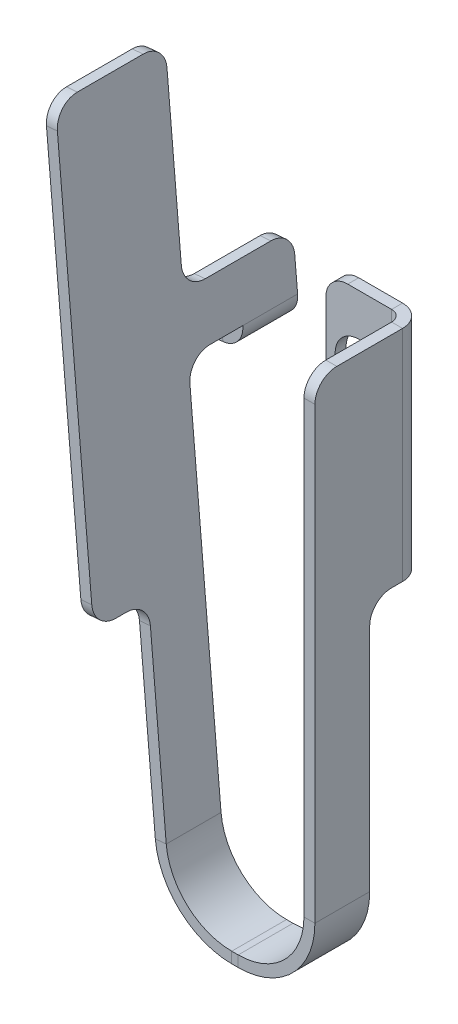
ISO-10303-21;
HEADER;
FILE_DESCRIPTION(('STEP AP214'),'2;1');
FILE_NAME('part.step','',(''),(''),'','','');
FILE_SCHEMA(('AUTOMOTIVE_DESIGN { 1 0 10303 214 1 1 1 1 }'));
ENDSEC;
DATA;
#1=APPLICATION_CONTEXT('core data for automotive mechanical design processes');
#2=APPLICATION_PROTOCOL_DEFINITION('international standard','automotive_design',2000,#1);
#3=PRODUCT_CONTEXT('',#1,'mechanical');
#4=PRODUCT('Part','Part','',(#3));
#5=PRODUCT_RELATED_PRODUCT_CATEGORY('part','',(#4));
#6=PRODUCT_DEFINITION_FORMATION('','',#4);
#7=PRODUCT_DEFINITION_CONTEXT('part definition',#1,'design');
#8=PRODUCT_DEFINITION('design','',#6,#7);
#9=PRODUCT_DEFINITION_SHAPE('','',#8);
#10=(LENGTH_UNIT() NAMED_UNIT(*) SI_UNIT(.MILLI.,.METRE.));
#11=(NAMED_UNIT(*) PLANE_ANGLE_UNIT() SI_UNIT($,.RADIAN.));
#12=(NAMED_UNIT(*) SI_UNIT($,.STERADIAN.) SOLID_ANGLE_UNIT());
#13=UNCERTAINTY_MEASURE_WITH_UNIT(LENGTH_MEASURE(1.E-05),#10,'distance_accuracy_value','');
#14=(GEOMETRIC_REPRESENTATION_CONTEXT(3) GLOBAL_UNCERTAINTY_ASSIGNED_CONTEXT((#13)) GLOBAL_UNIT_ASSIGNED_CONTEXT((#10,
#11,#12)) REPRESENTATION_CONTEXT('',''));
#15=CARTESIAN_POINT('',(0.,0.,0.));
#16=DIRECTION('',(0.,0.,1.));
#17=DIRECTION('',(1.,0.,0.));
#18=AXIS2_PLACEMENT_3D('',#15,#16,#17);
#19=CARTESIAN_POINT('',(-7.58659811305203,-49.,5.));
#20=DIRECTION('',(0.,0.,1.));
#21=DIRECTION('',(1.,0.,0.));
#22=AXIS2_PLACEMENT_3D('',#19,#20,#21);
#23=PLANE('',#22);
#24=DIRECTION('',(-0.087155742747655,0.996194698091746,0.));
#25=VECTOR('',#24,1.);
#26=CARTESIAN_POINT('',(-13.0038053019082,-49.9128442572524,5.));
#27=LINE('',#26,#25);
#28=CARTESIAN_POINT('',(-13.5627701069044,-43.5238473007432,5.));
#29=VERTEX_POINT('',#28);
#30=CARTESIAN_POINT('',(-15.0083873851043,-27.0003662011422,5.));
#31=VERTEX_POINT('',#30);
#32=EDGE_CURVE('E685',#29,#31,#27,.T.);
#33=ORIENTED_EDGE('',*,*,#32,.T.);
#34=DIRECTION('',(0.996194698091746,0.0871557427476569,0.));
#35=VECTOR('',#34,1.);
#36=CARTESIAN_POINT('',(-9.55307310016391,-26.5230880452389,5.));
#37=LINE('',#36,#35);
#38=CARTESIAN_POINT('',(-16.0045820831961,-27.0875219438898,5.));
#39=VERTEX_POINT('',#38);
#40=EDGE_CURVE('E438',#31,#39,#37,.F.);
#41=ORIENTED_EDGE('',*,*,#40,.T.);
#42=DIRECTION('',(-0.0871557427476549,0.996194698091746,0.));
#43=VECTOR('',#42,1.);
#44=CARTESIAN_POINT('',(-14.,-50.,5.));
#45=LINE('',#44,#43);
#46=CARTESIAN_POINT('',(-14.5589648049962,-43.6110030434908,5.));
#47=VERTEX_POINT('',#46);
#48=EDGE_CURVE('E748',#47,#39,#45,.T.);
#49=ORIENTED_EDGE('',*,*,#48,.F.);
#50=DIRECTION('',(0.996194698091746,0.0871557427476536,0.));
#51=VECTOR('',#50,1.);
#52=CARTESIAN_POINT('',(-14.5589648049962,-43.6110030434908,5.));
#53=LINE('',#52,#51);
#54=EDGE_CURVE('E716',#47,#29,#53,.T.);
#55=ORIENTED_EDGE('',*,*,#54,.T.);
#56=EDGE_LOOP('',(#33,#41,#49,#55));
#57=FACE_BOUND('',#56,.T.);
#58=ADVANCED_FACE('F36',(#57),#23,.T.);
#59=CARTESIAN_POINT('',(-22.3800474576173,-11.5841854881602,-10.));
#60=DIRECTION('',(0.996194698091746,0.0871557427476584,0.));
#61=DIRECTION('',(-0.0871557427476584,0.996194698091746,0.));
#62=AXIS2_PLACEMENT_3D('',#59,#60,#61);
#63=PLANE('',#62);
#64=DIRECTION('',(0.,0.,-1.));
#65=VECTOR('',#64,1.);
#66=CARTESIAN_POINT('',(-22.4672032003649,-10.5879907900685,-10.));
#67=LINE('',#66,#65);
#68=CARTESIAN_POINT('',(-22.4672032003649,-10.5879907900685,-5.));
#69=VERTEX_POINT('',#68);
#70=CARTESIAN_POINT('',(-22.4672032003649,-10.5879907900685,-5.5));
#71=VERTEX_POINT('',#70);
#72=EDGE_CURVE('E328',#69,#71,#67,.T.);
#73=ORIENTED_EDGE('',*,*,#72,.T.);
#74=DIRECTION('',(0.0871557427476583,-0.996194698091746,0.));
#75=VECTOR('',#74,1.);
#76=CARTESIAN_POINT('',(-24.6750433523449,14.6477376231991,-5.5));
#77=LINE('',#76,#75);
#78=CARTESIAN_POINT('',(-22.3800474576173,-11.5841854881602,-5.5));
#79=VERTEX_POINT('',#78);
#80=EDGE_CURVE('E309',#71,#79,#77,.T.);
#81=ORIENTED_EDGE('',*,*,#80,.T.);
#82=DIRECTION('',(0.,0.,-1.));
#83=VECTOR('',#82,1.);
#84=CARTESIAN_POINT('',(-22.3800474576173,-11.5841854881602,-10.));
#85=LINE('',#84,#83);
#86=CARTESIAN_POINT('',(-22.3800474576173,-11.5841854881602,-5.));
#87=VERTEX_POINT('',#86);
#88=EDGE_CURVE('E1475',#87,#79,#85,.T.);
#89=ORIENTED_EDGE('',*,*,#88,.F.);
#90=DIRECTION('',(-0.0871557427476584,0.996194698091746,0.));
#91=VECTOR('',#90,1.);
#92=CARTESIAN_POINT('',(-22.3800474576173,-11.5841854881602,-5.));
#93=LINE('',#92,#91);
#94=EDGE_CURVE('E336',#87,#69,#93,.T.);
#95=ORIENTED_EDGE('',*,*,#94,.T.);
#96=EDGE_LOOP('',(#73,#81,#89,#95));
#97=FACE_BOUND('',#96,.T.);
#98=ADVANCED_FACE('F334',(#97),#63,.F.);
#99=CARTESIAN_POINT('',(-13.0038053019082,-49.9128442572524,5.));
#100=DIRECTION('',(-0.996194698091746,-0.087155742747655,0.));
#101=DIRECTION('',(0.0871557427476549,-0.996194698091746,0.));
#102=AXIS2_PLACEMENT_3D('',#99,#100,#101);
#103=PLANE('',#102);
#104=DIRECTION('',(0.0871557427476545,-0.996194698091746,0.));
#105=VECTOR('',#104,1.);
#106=CARTESIAN_POINT('',(-17.0129694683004,-4.08788814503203,-10.));
#107=LINE('',#106,#105);
#108=CARTESIAN_POINT('',(-16.8386579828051,-6.08027754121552,-10.));
#109=VERTEX_POINT('',#108);
#110=CARTESIAN_POINT('',(-16.5771907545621,-9.06886163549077,-10.));
#111=VERTEX_POINT('',#110);
#112=EDGE_CURVE('E364',#109,#111,#107,.T.);
#113=ORIENTED_EDGE('',*,*,#112,.F.);
#114=CARTESIAN_POINT('',(-16.8386579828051,-6.08027754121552,-8.));
#115=DIRECTION('',(-0.996194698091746,-0.087155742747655,0.));
#116=DIRECTION('',(0.0871557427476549,-0.996194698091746,0.));
#117=AXIS2_PLACEMENT_3D('',#114,#115,#116);
#118=CIRCLE('',#117,2.);
#119=CARTESIAN_POINT('',(-17.0129694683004,-4.08788814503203,-8.));
#120=VERTEX_POINT('',#119);
#121=EDGE_CURVE('E388',#109,#120,#118,.F.);
#122=ORIENTED_EDGE('',*,*,#121,.T.);
#123=DIRECTION('',(0.,0.,1.));
#124=VECTOR('',#123,1.);
#125=CARTESIAN_POINT('',(-17.0129694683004,-4.08788814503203,-10.));
#126=LINE('',#125,#124);
#127=CARTESIAN_POINT('',(-17.0129694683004,-4.08788814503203,-2.));
#128=VERTEX_POINT('',#127);
#129=EDGE_CURVE('E479',#120,#128,#126,.T.);
#130=ORIENTED_EDGE('',*,*,#129,.T.);
#131=CARTESIAN_POINT('',(-17.1872809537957,-2.09549874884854,-2.));
#132=DIRECTION('',(-0.996194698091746,-0.087155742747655,0.));
#133=DIRECTION('',(0.0871557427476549,-0.996194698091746,0.));
#134=AXIS2_PLACEMENT_3D('',#131,#132,#133);
#135=CIRCLE('',#134,2.);
#136=CARTESIAN_POINT('',(-17.1872809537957,-2.09549874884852,0.));
#137=VERTEX_POINT('',#136);
#138=EDGE_CURVE('E44',#128,#137,#135,.T.);
#139=ORIENTED_EDGE('',*,*,#138,.T.);
#140=DIRECTION('',(-0.087155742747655,0.996194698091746,0.));
#141=VECTOR('',#140,1.);
#142=CARTESIAN_POINT('',(-13.0038053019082,-49.9128442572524,0.));
#143=LINE('',#142,#141);
#144=CARTESIAN_POINT('',(-18.4946170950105,12.8474217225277,0.));
#145=VERTEX_POINT('',#144);
#146=EDGE_CURVE('E477',#137,#145,#143,.T.);
#147=ORIENTED_EDGE('',*,*,#146,.T.);
#148=CARTESIAN_POINT('',(-18.4946170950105,12.8474217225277,2.));
#149=DIRECTION('',(-0.996194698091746,-0.087155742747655,0.));
#150=DIRECTION('',(0.0871557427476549,-0.996194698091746,0.));
#151=AXIS2_PLACEMENT_3D('',#148,#149,#150);
#152=CIRCLE('',#151,2.);
#153=CARTESIAN_POINT('',(-18.6689285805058,14.8398111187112,2.));
#154=VERTEX_POINT('',#153);
#155=EDGE_CURVE('E384',#145,#154,#152,.F.);
#156=ORIENTED_EDGE('',*,*,#155,.T.);
#157=DIRECTION('',(0.,0.,-1.));
#158=VECTOR('',#157,1.);
#159=CARTESIAN_POINT('',(-18.6689285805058,14.8398111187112,5.));
#160=LINE('',#159,#158);
#161=CARTESIAN_POINT('',(-18.6689285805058,14.8398111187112,8.));
#162=VERTEX_POINT('',#161);
#163=EDGE_CURVE('E708',#162,#154,#160,.T.);
#164=ORIENTED_EDGE('',*,*,#163,.F.);
#165=CARTESIAN_POINT('',(-18.4946170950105,12.8474217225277,8.));
#166=DIRECTION('',(-0.996194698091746,-0.087155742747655,0.));
#167=DIRECTION('',(0.0871557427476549,-0.996194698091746,0.));
#168=AXIS2_PLACEMENT_3D('',#165,#166,#167);
#169=CIRCLE('',#168,2.);
#170=CARTESIAN_POINT('',(-18.4946170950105,12.8474217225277,10.));
#171=VERTEX_POINT('',#170);
#172=EDGE_CURVE('E381',#162,#171,#169,.F.);
#173=ORIENTED_EDGE('',*,*,#172,.T.);
#174=DIRECTION('',(-0.0871557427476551,0.996194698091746,0.));
#175=VECTOR('',#174,1.);
#176=CARTESIAN_POINT('',(-18.6689285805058,14.8398111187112,10.));
#177=LINE('',#176,#175);
#178=CARTESIAN_POINT('',(-15.3570103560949,-23.0155874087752,10.));
#179=VERTEX_POINT('',#178);
#180=EDGE_CURVE('E1456',#179,#171,#177,.T.);
#181=ORIENTED_EDGE('',*,*,#180,.F.);
#182=CARTESIAN_POINT('',(-15.3570103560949,-23.0155874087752,8.));
#183=DIRECTION('',(-0.996194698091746,-0.087155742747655,0.));
#184=DIRECTION('',(0.0871557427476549,-0.996194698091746,0.));
#185=AXIS2_PLACEMENT_3D('',#182,#183,#184);
#186=CIRCLE('',#185,2.);
#187=CARTESIAN_POINT('',(-15.1826988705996,-25.0079768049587,8.));
#188=VERTEX_POINT('',#187);
#189=EDGE_CURVE('E386',#179,#188,#186,.F.);
#190=ORIENTED_EDGE('',*,*,#189,.T.);
#191=DIRECTION('',(0.,0.,-1.));
#192=VECTOR('',#191,1.);
#193=CARTESIAN_POINT('',(-15.1826988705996,-25.0079768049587,10.));
#194=LINE('',#193,#192);
#195=CARTESIAN_POINT('',(-15.1826988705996,-25.0079768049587,7.));
#196=VERTEX_POINT('',#195);
#197=EDGE_CURVE('E1454',#188,#196,#194,.T.);
#198=ORIENTED_EDGE('',*,*,#197,.T.);
#199=CARTESIAN_POINT('',(-15.0083873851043,-27.0003662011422,7.));
#200=DIRECTION('',(-0.996194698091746,-0.087155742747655,0.));
#201=DIRECTION('',(0.0871557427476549,-0.996194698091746,0.));
#202=AXIS2_PLACEMENT_3D('',#199,#200,#201);
#203=CIRCLE('',#202,2.);
#204=EDGE_CURVE('E464',#196,#31,#203,.T.);
#205=ORIENTED_EDGE('',*,*,#204,.T.);
#206=ORIENTED_EDGE('',*,*,#32,.F.);
#207=DIRECTION('',(0.,0.,-1.));
#208=VECTOR('',#207,1.);
#209=CARTESIAN_POINT('',(-13.5627701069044,-43.5238473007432,5.));
#210=LINE('',#209,#208);
#211=CARTESIAN_POINT('',(-13.5627701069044,-43.5238473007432,0.));
#212=VERTEX_POINT('',#211);
#213=EDGE_CURVE('E662',#29,#212,#210,.T.);
#214=ORIENTED_EDGE('',*,*,#213,.T.);
#215=CARTESIAN_POINT('',(-16.4028792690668,-11.0612510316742,0.));
#216=VERTEX_POINT('',#215);
#217=EDGE_CURVE('E488',#212,#216,#143,.T.);
#218=ORIENTED_EDGE('',*,*,#217,.T.);
#219=CARTESIAN_POINT('',(-16.4028792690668,-11.0612510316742,-2.));
#220=DIRECTION('',(-0.996194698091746,-0.087155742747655,0.));
#221=DIRECTION('',(0.0871557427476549,-0.996194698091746,0.));
#222=AXIS2_PLACEMENT_3D('',#219,#220,#221);
#223=CIRCLE('',#222,2.);
#224=CARTESIAN_POINT('',(-16.5771907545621,-9.06886163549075,-2.));
#225=VERTEX_POINT('',#224);
#226=EDGE_CURVE('E470',#216,#225,#223,.T.);
#227=ORIENTED_EDGE('',*,*,#226,.T.);
#228=DIRECTION('',(0.,0.,1.));
#229=VECTOR('',#228,1.);
#230=CARTESIAN_POINT('',(-16.5771907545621,-9.06886163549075,-10.));
#231=LINE('',#230,#229);
#232=CARTESIAN_POINT('',(-16.5771907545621,-9.06886163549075,-5.));
#233=VERTEX_POINT('',#232);
#234=EDGE_CURVE('E519',#233,#225,#231,.T.);
#235=ORIENTED_EDGE('',*,*,#234,.F.);
#236=EDGE_CURVE('E522',#111,#233,#231,.T.);
#237=ORIENTED_EDGE('',*,*,#236,.F.);
#238=EDGE_LOOP('',(#113,#122,#130,#139,#147,#156,#164,#173,#181,#190,#198,#205,#206,#214,#218,
#227,#235,#237));
#239=FACE_BOUND('',#238,.T.);
#240=ADVANCED_FACE('F476',(#239),#103,.F.);
#241=CARTESIAN_POINT('',(-14.,-50.,5.));
#242=DIRECTION('',(-0.996194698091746,-0.0871557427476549,0.));
#243=DIRECTION('',(0.0871557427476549,-0.996194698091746,0.));
#244=AXIS2_PLACEMENT_3D('',#241,#242,#243);
#245=PLANE('',#244);
#246=DIRECTION('',(0.,0.,1.));
#247=VECTOR('',#246,1.);
#248=CARTESIAN_POINT('',(-18.0091641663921,-4.17504388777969,-10.));
#249=LINE('',#248,#247);
#250=CARTESIAN_POINT('',(-18.0091641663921,-4.17504388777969,-8.));
#251=VERTEX_POINT('',#250);
#252=CARTESIAN_POINT('',(-18.0091641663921,-4.17504388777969,-2.));
#253=VERTEX_POINT('',#252);
#254=EDGE_CURVE('E496',#251,#253,#249,.T.);
#255=ORIENTED_EDGE('',*,*,#254,.F.);
#256=CARTESIAN_POINT('',(-17.8348526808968,-6.16743328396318,-8.));
#257=DIRECTION('',(-0.996194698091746,-0.0871557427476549,0.));
#258=DIRECTION('',(0.0871557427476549,-0.996194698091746,0.));
#259=AXIS2_PLACEMENT_3D('',#256,#257,#258);
#260=CIRCLE('',#259,2.);
#261=CARTESIAN_POINT('',(-17.8348526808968,-6.16743328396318,-10.));
#262=VERTEX_POINT('',#261);
#263=EDGE_CURVE('E401',#251,#262,#260,.T.);
#264=ORIENTED_EDGE('',*,*,#263,.T.);
#265=DIRECTION('',(-0.0871557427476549,0.996194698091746,0.));
#266=VECTOR('',#265,1.);
#267=CARTESIAN_POINT('',(-18.0091641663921,-4.17504388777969,-10.));
#268=LINE('',#267,#266);
#269=CARTESIAN_POINT('',(-17.5733854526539,-9.15601737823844,-10.));
#270=VERTEX_POINT('',#269);
#271=EDGE_CURVE('E507',#270,#262,#268,.T.);
#272=ORIENTED_EDGE('',*,*,#271,.F.);
#273=DIRECTION('',(0.,0.,1.));
#274=VECTOR('',#273,1.);
#275=CARTESIAN_POINT('',(-17.5733854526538,-9.15601737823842,-10.));
#276=LINE('',#275,#274);
#277=CARTESIAN_POINT('',(-17.5733854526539,-9.15601737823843,-5.));
#278=VERTEX_POINT('',#277);
#279=EDGE_CURVE('E505',#270,#278,#276,.T.);
#280=ORIENTED_EDGE('',*,*,#279,.T.);
#281=CARTESIAN_POINT('',(-17.5733854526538,-9.15601737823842,-2.));
#282=VERTEX_POINT('',#281);
#283=EDGE_CURVE('E502',#278,#282,#276,.T.);
#284=ORIENTED_EDGE('',*,*,#283,.T.);
#285=CARTESIAN_POINT('',(-17.3990739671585,-11.1484067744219,-2.));
#286=DIRECTION('',(-0.996194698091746,-0.0871557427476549,0.));
#287=DIRECTION('',(0.0871557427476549,-0.996194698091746,0.));
#288=AXIS2_PLACEMENT_3D('',#285,#286,#287);
#289=CIRCLE('',#288,2.);
#290=CARTESIAN_POINT('',(-17.3990739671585,-11.1484067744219,0.));
#291=VERTEX_POINT('',#290);
#292=EDGE_CURVE('E468',#282,#291,#289,.F.);
#293=ORIENTED_EDGE('',*,*,#292,.T.);
#294=DIRECTION('',(-0.0871557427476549,0.996194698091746,0.));
#295=VECTOR('',#294,1.);
#296=CARTESIAN_POINT('',(-14.,-50.,0.));
#297=LINE('',#296,#295);
#298=CARTESIAN_POINT('',(-14.5589648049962,-43.6110030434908,0.));
#299=VERTEX_POINT('',#298);
#300=EDGE_CURVE('E664',#299,#291,#297,.T.);
#301=ORIENTED_EDGE('',*,*,#300,.F.);
#302=DIRECTION('',(0.,0.,-1.));
#303=VECTOR('',#302,1.);
#304=CARTESIAN_POINT('',(-14.5589648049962,-43.6110030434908,5.));
#305=LINE('',#304,#303);
#306=EDGE_CURVE('E702',#47,#299,#305,.T.);
#307=ORIENTED_EDGE('',*,*,#306,.F.);
#308=ORIENTED_EDGE('',*,*,#48,.T.);
#309=CARTESIAN_POINT('',(-16.0045820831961,-27.0875219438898,7.));
#310=DIRECTION('',(-0.996194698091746,-0.0871557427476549,0.));
#311=DIRECTION('',(0.0871557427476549,-0.996194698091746,0.));
#312=AXIS2_PLACEMENT_3D('',#309,#310,#311);
#313=CIRCLE('',#312,2.);
#314=CARTESIAN_POINT('',(-16.1788935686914,-25.0951325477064,7.));
#315=VERTEX_POINT('',#314);
#316=EDGE_CURVE('E466',#39,#315,#313,.F.);
#317=ORIENTED_EDGE('',*,*,#316,.T.);
#318=DIRECTION('',(0.,0.,-1.));
#319=VECTOR('',#318,1.);
#320=CARTESIAN_POINT('',(-16.1788935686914,-25.0951325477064,10.));
#321=LINE('',#320,#319);
#322=CARTESIAN_POINT('',(-16.1788935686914,-25.0951325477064,8.));
#323=VERTEX_POINT('',#322);
#324=EDGE_CURVE('E332',#323,#315,#321,.T.);
#325=ORIENTED_EDGE('',*,*,#324,.F.);
#326=CARTESIAN_POINT('',(-16.3532050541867,-23.1027431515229,8.));
#327=DIRECTION('',(-0.996194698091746,-0.0871557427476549,0.));
#328=DIRECTION('',(0.0871557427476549,-0.996194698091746,0.));
#329=AXIS2_PLACEMENT_3D('',#326,#327,#328);
#330=CIRCLE('',#329,2.);
#331=CARTESIAN_POINT('',(-16.3532050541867,-23.1027431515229,10.));
#332=VERTEX_POINT('',#331);
#333=EDGE_CURVE('E399',#323,#332,#330,.T.);
#334=ORIENTED_EDGE('',*,*,#333,.T.);
#335=DIRECTION('',(0.087155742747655,-0.996194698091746,0.));
#336=VECTOR('',#335,1.);
#337=CARTESIAN_POINT('',(-19.6651232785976,14.7526553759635,10.));
#338=LINE('',#337,#336);
#339=CARTESIAN_POINT('',(-19.4908117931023,12.76026597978,10.));
#340=VERTEX_POINT('',#339);
#341=EDGE_CURVE('E1486',#340,#332,#338,.T.);
#342=ORIENTED_EDGE('',*,*,#341,.F.);
#343=CARTESIAN_POINT('',(-19.4908117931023,12.76026597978,8.));
#344=DIRECTION('',(-0.996194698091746,-0.0871557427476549,0.));
#345=DIRECTION('',(0.0871557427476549,-0.996194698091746,0.));
#346=AXIS2_PLACEMENT_3D('',#343,#344,#345);
#347=CIRCLE('',#346,2.);
#348=CARTESIAN_POINT('',(-19.6651232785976,14.7526553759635,8.));
#349=VERTEX_POINT('',#348);
#350=EDGE_CURVE('E395',#340,#349,#347,.T.);
#351=ORIENTED_EDGE('',*,*,#350,.T.);
#352=DIRECTION('',(0.,0.,-1.));
#353=VECTOR('',#352,1.);
#354=CARTESIAN_POINT('',(-19.6651232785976,14.7526553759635,5.));
#355=LINE('',#354,#353);
#356=CARTESIAN_POINT('',(-19.6651232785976,14.7526553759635,2.));
#357=VERTEX_POINT('',#356);
#358=EDGE_CURVE('E705',#349,#357,#355,.T.);
#359=ORIENTED_EDGE('',*,*,#358,.T.);
#360=CARTESIAN_POINT('',(-19.4908117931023,12.76026597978,2.));
#361=DIRECTION('',(-0.996194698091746,-0.0871557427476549,0.));
#362=DIRECTION('',(0.0871557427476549,-0.996194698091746,0.));
#363=AXIS2_PLACEMENT_3D('',#360,#361,#362);
#364=CIRCLE('',#363,2.);
#365=CARTESIAN_POINT('',(-19.4908117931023,12.76026597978,0.));
#366=VERTEX_POINT('',#365);
#367=EDGE_CURVE('E397',#357,#366,#364,.T.);
#368=ORIENTED_EDGE('',*,*,#367,.T.);
#369=CARTESIAN_POINT('',(-18.1834756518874,-2.1826544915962,0.));
#370=VERTEX_POINT('',#369);
#371=EDGE_CURVE('E498',#370,#366,#297,.T.);
#372=ORIENTED_EDGE('',*,*,#371,.F.);
#373=CARTESIAN_POINT('',(-18.1834756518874,-2.18265449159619,-2.));
#374=DIRECTION('',(-0.996194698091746,-0.0871557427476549,0.));
#375=DIRECTION('',(0.0871557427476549,-0.996194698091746,0.));
#376=AXIS2_PLACEMENT_3D('',#373,#374,#375);
#377=CIRCLE('',#376,2.);
#378=EDGE_CURVE('E11',#370,#253,#377,.F.);
#379=ORIENTED_EDGE('',*,*,#378,.T.);
#380=EDGE_LOOP('',(#255,#264,#272,#280,#284,#293,#301,#307,#308,#317,#325,#334,#342,#351,#359,
#368,#372,#379));
#381=FACE_BOUND('',#380,.T.);
#382=ADVANCED_FACE('F495',(#381),#245,.T.);
#383=CARTESIAN_POINT('',(-16.5771907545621,-9.06886163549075,-10.));
#384=DIRECTION('',(-0.0871557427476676,0.996194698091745,0.));
#385=DIRECTION('',(-0.996194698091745,-0.0871557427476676,0.));
#386=AXIS2_PLACEMENT_3D('',#383,#384,#385);
#387=PLANE('',#386);
#388=ORIENTED_EDGE('',*,*,#234,.T.);
#389=DIRECTION('',(-0.996194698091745,-0.0871557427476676,0.));
#390=VECTOR('',#389,1.);
#391=CARTESIAN_POINT('',(-17.5733854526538,-9.15601737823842,-2.));
#392=LINE('',#391,#390);
#393=EDGE_CURVE('E455',#225,#282,#392,.T.);
#394=ORIENTED_EDGE('',*,*,#393,.T.);
#395=ORIENTED_EDGE('',*,*,#283,.F.);
#396=DIRECTION('',(0.996194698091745,0.0871557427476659,0.));
#397=VECTOR('',#396,1.);
#398=CARTESIAN_POINT('',(-17.5733854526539,-9.15601737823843,-5.));
#399=LINE('',#398,#397);
#400=EDGE_CURVE('E356',#278,#233,#399,.T.);
#401=ORIENTED_EDGE('',*,*,#400,.T.);
#402=EDGE_LOOP('',(#388,#394,#395,#401));
#403=FACE_BOUND('',#402,.T.);
#404=ADVANCED_FACE('F539',(#403),#387,.F.);
#405=CARTESIAN_POINT('',(-7.58659811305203,-43.001,0.));
#406=DIRECTION('',(0.,0.,1.));
#407=DIRECTION('',(1.,0.,0.));
#408=AXIS2_PLACEMENT_3D('',#405,#406,#407);
#409=PLANE('',#408);
#410=ORIENTED_EDGE('',*,*,#300,.T.);
#411=DIRECTION('',(-0.996194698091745,-0.0871557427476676,0.));
#412=VECTOR('',#411,1.);
#413=CARTESIAN_POINT('',(-16.4028792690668,-11.0612510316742,0.));
#414=LINE('',#413,#412);
#415=EDGE_CURVE('E458',#291,#216,#414,.F.);
#416=ORIENTED_EDGE('',*,*,#415,.T.);
#417=ORIENTED_EDGE('',*,*,#217,.F.);
#418=DIRECTION('',(-0.996194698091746,-0.0871557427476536,0.));
#419=VECTOR('',#418,1.);
#420=CARTESIAN_POINT('',(-13.5627701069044,-43.5238473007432,0.));
#421=LINE('',#420,#419);
#422=EDGE_CURVE('E711',#212,#299,#421,.T.);
#423=ORIENTED_EDGE('',*,*,#422,.T.);
#424=EDGE_LOOP('',(#410,#416,#417,#423));
#425=FACE_BOUND('',#424,.T.);
#426=ADVANCED_FACE('F1132',(#425),#409,.F.);
#427=ORIENTED_EDGE('',*,*,#371,.T.);
#428=DIRECTION('',(0.996194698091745,0.0871557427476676,0.));
#429=VECTOR('',#428,1.);
#430=CARTESIAN_POINT('',(-18.4946170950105,12.8474217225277,0.));
#431=LINE('',#430,#429);
#432=EDGE_CURVE('E448',#366,#145,#431,.T.);
#433=ORIENTED_EDGE('',*,*,#432,.T.);
#434=ORIENTED_EDGE('',*,*,#146,.F.);
#435=DIRECTION('',(0.996194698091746,0.0871557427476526,0.));
#436=VECTOR('',#435,1.);
#437=CARTESIAN_POINT('',(-18.1834756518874,-2.18265449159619,0.));
#438=LINE('',#437,#436);
#439=EDGE_CURVE('E446',#137,#370,#438,.F.);
#440=ORIENTED_EDGE('',*,*,#439,.T.);
#441=EDGE_LOOP('',(#427,#433,#434,#440));
#442=FACE_BOUND('',#441,.T.);
#443=ADVANCED_FACE('F485',(#442),#409,.F.);
#444=CARTESIAN_POINT('',(0.,0.,5.));
#445=DIRECTION('',(1.,0.,0.));
#446=DIRECTION('',(0.,1.,0.));
#447=AXIS2_PLACEMENT_3D('',#444,#445,#446);
#448=PLANE('',#447);
#449=DIRECTION('',(0.,0.,-1.));
#450=VECTOR('',#449,1.);
#451=CARTESIAN_POINT('',(0.,0.,5.));
#452=LINE('',#451,#450);
#453=CARTESIAN_POINT('',(0.,0.,3.));
#454=VERTEX_POINT('',#453);
#455=CARTESIAN_POINT('',(0.,0.,-3.));
#456=VERTEX_POINT('',#455);
#457=EDGE_CURVE('E698',#454,#456,#452,.T.);
#458=ORIENTED_EDGE('',*,*,#457,.F.);
#459=CARTESIAN_POINT('',(0.,-2.,3.));
#460=DIRECTION('',(1.,0.,0.));
#461=DIRECTION('',(0.,1.,0.));
#462=AXIS2_PLACEMENT_3D('',#459,#460,#461);
#463=CIRCLE('',#462,2.);
#464=CARTESIAN_POINT('',(0.,-2.,5.));
#465=VERTEX_POINT('',#464);
#466=EDGE_CURVE('E59',#454,#465,#463,.T.);
#467=ORIENTED_EDGE('',*,*,#466,.T.);
#468=DIRECTION('',(0.,-1.,0.));
#469=VECTOR('',#468,1.);
#470=CARTESIAN_POINT('',(0.,0.,5.));
#471=LINE('',#470,#469);
#472=CARTESIAN_POINT('',(0.,-43.001,5.));
#473=VERTEX_POINT('',#472);
#474=EDGE_CURVE('E650',#465,#473,#471,.T.);
#475=ORIENTED_EDGE('',*,*,#474,.T.);
#476=DIRECTION('',(0.,0.,-1.));
#477=VECTOR('',#476,1.);
#478=CARTESIAN_POINT('',(0.,-43.001,5.));
#479=LINE('',#478,#477);
#480=CARTESIAN_POINT('',(0.,-43.001,0.));
#481=VERTEX_POINT('',#480);
#482=EDGE_CURVE('E641',#473,#481,#479,.T.);
#483=ORIENTED_EDGE('',*,*,#482,.T.);
#484=DIRECTION('',(0.,-1.,0.));
#485=VECTOR('',#484,1.);
#486=CARTESIAN_POINT('',(0.,0.,0.));
#487=LINE('',#486,#485);
#488=CARTESIAN_POINT('',(0.,-22.,0.));
#489=VERTEX_POINT('',#488);
#490=EDGE_CURVE('E672',#489,#481,#487,.T.);
#491=ORIENTED_EDGE('',*,*,#490,.F.);
#492=CARTESIAN_POINT('',(0.,-22.,-2.));
#493=DIRECTION('',(1.,0.,0.));
#494=DIRECTION('',(0.,1.,0.));
#495=AXIS2_PLACEMENT_3D('',#492,#493,#494);
#496=CIRCLE('',#495,2.);
#497=CARTESIAN_POINT('',(0.,-20.,-2.));
#498=VERTEX_POINT('',#497);
#499=EDGE_CURVE('E462',#489,#498,#496,.F.);
#500=ORIENTED_EDGE('',*,*,#499,.T.);
#501=DIRECTION('',(0.,0.,1.));
#502=VECTOR('',#501,1.);
#503=CARTESIAN_POINT('',(0.,-20.,-4.));
#504=LINE('',#503,#502);
#505=CARTESIAN_POINT('',(0.,-20.,-3.));
#506=VERTEX_POINT('',#505);
#507=EDGE_CURVE('E489',#506,#498,#504,.T.);
#508=ORIENTED_EDGE('',*,*,#507,.F.);
#509=DIRECTION('',(0.,-1.,0.));
#510=VECTOR('',#509,1.);
#511=CARTESIAN_POINT('',(0.,-20.,-3.));
#512=LINE('',#511,#510);
#513=EDGE_CURVE('E778',#506,#456,#512,.F.);
#514=ORIENTED_EDGE('',*,*,#513,.T.);
#515=EDGE_LOOP('',(#458,#467,#475,#483,#491,#500,#508,#514));
#516=FACE_BOUND('',#515,.T.);
#517=ADVANCED_FACE('F1114',(#516),#448,.T.);
#518=CARTESIAN_POINT('',(-1.,0.,5.));
#519=DIRECTION('',(1.,0.,0.));
#520=DIRECTION('',(0.,1.,0.));
#521=AXIS2_PLACEMENT_3D('',#518,#519,#520);
#522=PLANE('',#521);
#523=DIRECTION('',(0.,-1.,0.));
#524=VECTOR('',#523,1.);
#525=CARTESIAN_POINT('',(-1.,0.,5.));
#526=LINE('',#525,#524);
#527=CARTESIAN_POINT('',(-1.,-2.,5.));
#528=VERTEX_POINT('',#527);
#529=CARTESIAN_POINT('',(-0.999999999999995,-43.001,5.));
#530=VERTEX_POINT('',#529);
#531=EDGE_CURVE('E652',#528,#530,#526,.T.);
#532=ORIENTED_EDGE('',*,*,#531,.F.);
#533=CARTESIAN_POINT('',(-1.,-2.,3.));
#534=DIRECTION('',(1.,0.,0.));
#535=DIRECTION('',(0.,1.,0.));
#536=AXIS2_PLACEMENT_3D('',#533,#534,#535);
#537=CIRCLE('',#536,2.);
#538=CARTESIAN_POINT('',(-1.,0.,3.));
#539=VERTEX_POINT('',#538);
#540=EDGE_CURVE('E431',#528,#539,#537,.F.);
#541=ORIENTED_EDGE('',*,*,#540,.T.);
#542=DIRECTION('',(0.,0.,-1.));
#543=VECTOR('',#542,1.);
#544=CARTESIAN_POINT('',(-1.,0.,5.));
#545=LINE('',#544,#543);
#546=CARTESIAN_POINT('',(-0.999999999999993,0.,-3.));
#547=VERTEX_POINT('',#546);
#548=EDGE_CURVE('E696',#539,#547,#545,.T.);
#549=ORIENTED_EDGE('',*,*,#548,.T.);
#550=DIRECTION('',(0.,-1.,0.));
#551=VECTOR('',#550,1.);
#552=CARTESIAN_POINT('',(-0.999999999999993,-20.,-3.));
#553=LINE('',#552,#551);
#554=CARTESIAN_POINT('',(-0.999999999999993,-20.,-3.));
#555=VERTEX_POINT('',#554);
#556=EDGE_CURVE('E768',#555,#547,#553,.F.);
#557=ORIENTED_EDGE('',*,*,#556,.F.);
#558=DIRECTION('',(0.,0.,1.));
#559=VECTOR('',#558,1.);
#560=CARTESIAN_POINT('',(-1.,-20.,-4.));
#561=LINE('',#560,#559);
#562=CARTESIAN_POINT('',(-1.,-20.,-2.));
#563=VERTEX_POINT('',#562);
#564=EDGE_CURVE('E755',#555,#563,#561,.T.);
#565=ORIENTED_EDGE('',*,*,#564,.T.);
#566=CARTESIAN_POINT('',(-0.999999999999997,-22.,-2.));
#567=DIRECTION('',(1.,0.,0.));
#568=DIRECTION('',(0.,1.,0.));
#569=AXIS2_PLACEMENT_3D('',#566,#567,#568);
#570=CIRCLE('',#569,2.);
#571=CARTESIAN_POINT('',(-0.999999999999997,-22.,0.));
#572=VERTEX_POINT('',#571);
#573=EDGE_CURVE('E460',#563,#572,#570,.T.);
#574=ORIENTED_EDGE('',*,*,#573,.T.);
#575=DIRECTION('',(0.,-1.,0.));
#576=VECTOR('',#575,1.);
#577=CARTESIAN_POINT('',(-1.,0.,0.));
#578=LINE('',#577,#576);
#579=CARTESIAN_POINT('',(-0.999999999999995,-43.001,0.));
#580=VERTEX_POINT('',#579);
#581=EDGE_CURVE('E674',#572,#580,#578,.T.);
#582=ORIENTED_EDGE('',*,*,#581,.T.);
#583=DIRECTION('',(0.,0.,-1.));
#584=VECTOR('',#583,1.);
#585=CARTESIAN_POINT('',(-0.999999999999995,-43.001,5.));
#586=LINE('',#585,#584);
#587=EDGE_CURVE('E693',#530,#580,#586,.T.);
#588=ORIENTED_EDGE('',*,*,#587,.F.);
#589=EDGE_LOOP('',(#532,#541,#549,#557,#565,#574,#582,#588));
#590=FACE_BOUND('',#589,.T.);
#591=ADVANCED_FACE('F727',(#590),#522,.F.);
#592=CARTESIAN_POINT('',(0.,-20.,-4.));
#593=DIRECTION('',(0.,1.,0.));
#594=DIRECTION('',(0.,0.,1.));
#595=AXIS2_PLACEMENT_3D('',#592,#593,#594);
#596=PLANE('',#595);
#597=ORIENTED_EDGE('',*,*,#507,.T.);
#598=DIRECTION('',(-1.,0.,0.));
#599=VECTOR('',#598,1.);
#600=CARTESIAN_POINT('',(0.,-20.,-2.));
#601=LINE('',#600,#599);
#602=EDGE_CURVE('E403',#498,#563,#601,.T.);
#603=ORIENTED_EDGE('',*,*,#602,.T.);
#604=ORIENTED_EDGE('',*,*,#564,.F.);
#605=DIRECTION('',(1.,0.,0.));
#606=VECTOR('',#605,1.);
#607=CARTESIAN_POINT('',(-0.999999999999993,-20.,-3.));
#608=LINE('',#607,#606);
#609=EDGE_CURVE('E759',#555,#506,#608,.T.);
#610=ORIENTED_EDGE('',*,*,#609,.T.);
#611=EDGE_LOOP('',(#597,#603,#604,#610));
#612=FACE_BOUND('',#611,.T.);
#613=ADVANCED_FACE('F603',(#612),#596,.F.);
#614=CARTESIAN_POINT('',(-6.999,-49.,0.));
#615=DIRECTION('',(0.,0.,-1.));
#616=DIRECTION('',(-1.,0.,0.));
#617=AXIS2_PLACEMENT_3D('',#614,#615,#616);
#618=PLANE('',#617);
#619=ORIENTED_EDGE('',*,*,#581,.F.);
#620=DIRECTION('',(-1.,0.,0.));
#621=VECTOR('',#620,1.);
#622=CARTESIAN_POINT('',(-6.999,-22.,0.));
#623=LINE('',#622,#621);
#624=EDGE_CURVE('E406',#572,#489,#623,.F.);
#625=ORIENTED_EDGE('',*,*,#624,.T.);
#626=ORIENTED_EDGE('',*,*,#490,.T.);
#627=DIRECTION('',(-1.,0.,0.));
#628=VECTOR('',#627,1.);
#629=CARTESIAN_POINT('',(0.,-43.001,0.));
#630=LINE('',#629,#628);
#631=EDGE_CURVE('E720',#481,#580,#630,.T.);
#632=ORIENTED_EDGE('',*,*,#631,.T.);
#633=EDGE_LOOP('',(#619,#625,#626,#632));
#634=FACE_BOUND('',#633,.T.);
#635=ADVANCED_FACE('F599',(#634),#618,.T.);
#636=CARTESIAN_POINT('',(-6.999,-50.,5.));
#637=DIRECTION('',(0.,0.,1.));
#638=DIRECTION('',(1.,0.,0.));
#639=AXIS2_PLACEMENT_3D('',#636,#637,#638);
#640=PLANE('',#639);
#641=DIRECTION('',(0.,1.,0.));
#642=VECTOR('',#641,1.);
#643=CARTESIAN_POINT('',(-6.999,-50.,5.));
#644=LINE('',#643,#642);
#645=CARTESIAN_POINT('',(-6.999,-50.,5.));
#646=VERTEX_POINT('',#645);
#647=CARTESIAN_POINT('',(-6.999,-49.,5.));
#648=VERTEX_POINT('',#647);
#649=EDGE_CURVE('E382',#646,#648,#644,.T.);
#650=ORIENTED_EDGE('',*,*,#649,.F.);
#651=CARTESIAN_POINT('',(-6.999,-43.001,5.));
#652=DIRECTION('',(0.,0.,1.));
#653=DIRECTION('',(1.,0.,0.));
#654=AXIS2_PLACEMENT_3D('',#651,#652,#653);
#655=CIRCLE('',#654,6.999);
#656=EDGE_CURVE('E620',#473,#646,#655,.F.);
#657=ORIENTED_EDGE('',*,*,#656,.F.);
#658=DIRECTION('',(1.,0.,0.));
#659=VECTOR('',#658,1.);
#660=CARTESIAN_POINT('',(-0.999999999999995,-43.001,5.));
#661=LINE('',#660,#659);
#662=EDGE_CURVE('E626',#530,#473,#661,.T.);
#663=ORIENTED_EDGE('',*,*,#662,.F.);
#664=CARTESIAN_POINT('',(-6.999,-43.001,5.));
#665=DIRECTION('',(0.,0.,1.));
#666=DIRECTION('',(1.,0.,0.));
#667=AXIS2_PLACEMENT_3D('',#664,#665,#666);
#668=CIRCLE('',#667,5.999);
#669=EDGE_CURVE('E622',#530,#648,#668,.F.);
#670=ORIENTED_EDGE('',*,*,#669,.T.);
#671=EDGE_LOOP('',(#650,#657,#663,#670));
#672=FACE_BOUND('',#671,.T.);
#673=ADVANCED_FACE('F602',(#672),#640,.T.);
#674=CARTESIAN_POINT('',(-0.999999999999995,-43.001,5.));
#675=DIRECTION('',(0.,0.,1.));
#676=DIRECTION('',(1.,0.,0.));
#677=AXIS2_PLACEMENT_3D('',#674,#675,#676);
#678=PLANE('',#677);
#679=DIRECTION('',(-1.,0.,0.));
#680=VECTOR('',#679,1.);
#681=CARTESIAN_POINT('',(0.,-50.,5.));
#682=LINE('',#681,#680);
#683=CARTESIAN_POINT('',(-7.58659811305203,-50.,5.));
#684=VERTEX_POINT('',#683);
#685=EDGE_CURVE('E634',#646,#684,#682,.T.);
#686=ORIENTED_EDGE('',*,*,#685,.F.);
#687=ORIENTED_EDGE('',*,*,#649,.T.);
#688=DIRECTION('',(1.,0.,0.));
#689=VECTOR('',#688,1.);
#690=CARTESIAN_POINT('',(0.,-49.,5.));
#691=LINE('',#690,#689);
#692=CARTESIAN_POINT('',(-7.58659811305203,-49.,5.));
#693=VERTEX_POINT('',#692);
#694=EDGE_CURVE('E658',#648,#693,#691,.F.);
#695=ORIENTED_EDGE('',*,*,#694,.T.);
#696=DIRECTION('',(0.,-1.,0.));
#697=VECTOR('',#696,1.);
#698=CARTESIAN_POINT('',(-7.58659811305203,-49.,5.));
#699=LINE('',#698,#697);
#700=EDGE_CURVE('E643',#693,#684,#699,.T.);
#701=ORIENTED_EDGE('',*,*,#700,.T.);
#702=EDGE_LOOP('',(#686,#687,#695,#701));
#703=FACE_BOUND('',#702,.T.);
#704=ADVANCED_FACE('F607',(#703),#678,.T.);
#705=CARTESIAN_POINT('',(0.,-43.001,0.));
#706=DIRECTION('',(0.,0.,-1.));
#707=DIRECTION('',(-1.,0.,0.));
#708=AXIS2_PLACEMENT_3D('',#705,#706,#707);
#709=PLANE('',#708);
#710=ORIENTED_EDGE('',*,*,#631,.F.);
#711=CARTESIAN_POINT('',(-6.999,-43.001,0.));
#712=DIRECTION('',(0.,0.,1.));
#713=DIRECTION('',(1.,0.,0.));
#714=AXIS2_PLACEMENT_3D('',#711,#712,#713);
#715=CIRCLE('',#714,6.999);
#716=CARTESIAN_POINT('',(-6.999,-50.,0.));
#717=VERTEX_POINT('',#716);
#718=EDGE_CURVE('E670',#481,#717,#715,.F.);
#719=ORIENTED_EDGE('',*,*,#718,.T.);
#720=DIRECTION('',(0.,-1.,0.));
#721=VECTOR('',#720,1.);
#722=CARTESIAN_POINT('',(-6.999,-49.,0.));
#723=LINE('',#722,#721);
#724=CARTESIAN_POINT('',(-6.999,-49.,0.));
#725=VERTEX_POINT('',#724);
#726=EDGE_CURVE('E718',#725,#717,#723,.T.);
#727=ORIENTED_EDGE('',*,*,#726,.F.);
#728=CARTESIAN_POINT('',(-6.999,-43.001,0.));
#729=DIRECTION('',(0.,0.,1.));
#730=DIRECTION('',(1.,0.,0.));
#731=AXIS2_PLACEMENT_3D('',#728,#729,#730);
#732=CIRCLE('',#731,5.999);
#733=EDGE_CURVE('E676',#580,#725,#732,.F.);
#734=ORIENTED_EDGE('',*,*,#733,.F.);
#735=EDGE_LOOP('',(#710,#719,#727,#734));
#736=FACE_BOUND('',#735,.T.);
#737=ADVANCED_FACE('F597',(#736),#709,.T.);
#738=CARTESIAN_POINT('',(-14.5589648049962,-43.6110030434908,5.));
#739=DIRECTION('',(0.,0.,1.));
#740=DIRECTION('',(1.,0.,0.));
#741=AXIS2_PLACEMENT_3D('',#738,#739,#740);
#742=PLANE('',#741);
#743=ORIENTED_EDGE('',*,*,#54,.F.);
#744=CARTESIAN_POINT('',(-7.58659811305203,-43.001,5.));
#745=DIRECTION('',(0.,0.,1.));
#746=DIRECTION('',(1.,0.,0.));
#747=AXIS2_PLACEMENT_3D('',#744,#745,#746);
#748=CIRCLE('',#747,6.999);
#749=EDGE_CURVE('E645',#684,#47,#748,.F.);
#750=ORIENTED_EDGE('',*,*,#749,.F.);
#751=ORIENTED_EDGE('',*,*,#700,.F.);
#752=CARTESIAN_POINT('',(-7.58659811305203,-43.001,5.));
#753=DIRECTION('',(0.,0.,1.));
#754=DIRECTION('',(1.,0.,0.));
#755=AXIS2_PLACEMENT_3D('',#752,#753,#754);
#756=CIRCLE('',#755,5.999);
#757=EDGE_CURVE('E660',#693,#29,#756,.F.);
#758=ORIENTED_EDGE('',*,*,#757,.T.);
#759=EDGE_LOOP('',(#743,#750,#751,#758));
#760=FACE_BOUND('',#759,.T.);
#761=ADVANCED_FACE('F594',(#760),#742,.T.);
#762=CARTESIAN_POINT('',(-7.58659811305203,-50.,0.));
#763=DIRECTION('',(0.,0.,-1.));
#764=DIRECTION('',(-1.,0.,0.));
#765=AXIS2_PLACEMENT_3D('',#762,#763,#764);
#766=PLANE('',#765);
#767=DIRECTION('',(0.,1.,0.));
#768=VECTOR('',#767,1.);
#769=CARTESIAN_POINT('',(-7.58659811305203,-50.,0.));
#770=LINE('',#769,#768);
#771=CARTESIAN_POINT('',(-7.58659811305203,-50.,0.));
#772=VERTEX_POINT('',#771);
#773=CARTESIAN_POINT('',(-7.58659811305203,-49.,0.));
#774=VERTEX_POINT('',#773);
#775=EDGE_CURVE('E713',#772,#774,#770,.T.);
#776=ORIENTED_EDGE('',*,*,#775,.F.);
#777=CARTESIAN_POINT('',(-7.58659811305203,-43.001,0.));
#778=DIRECTION('',(0.,0.,1.));
#779=DIRECTION('',(1.,0.,0.));
#780=AXIS2_PLACEMENT_3D('',#777,#778,#779);
#781=CIRCLE('',#780,6.999);
#782=EDGE_CURVE('E666',#772,#299,#781,.F.);
#783=ORIENTED_EDGE('',*,*,#782,.T.);
#784=ORIENTED_EDGE('',*,*,#422,.F.);
#785=CARTESIAN_POINT('',(-7.58659811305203,-43.001,0.));
#786=DIRECTION('',(0.,0.,1.));
#787=DIRECTION('',(1.,0.,0.));
#788=AXIS2_PLACEMENT_3D('',#785,#786,#787);
#789=CIRCLE('',#788,5.999);
#790=EDGE_CURVE('E682',#774,#212,#789,.F.);
#791=ORIENTED_EDGE('',*,*,#790,.F.);
#792=EDGE_LOOP('',(#776,#783,#784,#791));
#793=FACE_BOUND('',#792,.T.);
#794=ADVANCED_FACE('F592',(#793),#766,.T.);
#795=CARTESIAN_POINT('',(-13.5627701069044,-43.5238473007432,0.));
#796=DIRECTION('',(0.,0.,-1.));
#797=DIRECTION('',(-1.,0.,0.));
#798=AXIS2_PLACEMENT_3D('',#795,#796,#797);
#799=PLANE('',#798);
#800=DIRECTION('',(-1.,0.,0.));
#801=VECTOR('',#800,1.);
#802=CARTESIAN_POINT('',(0.,-50.,0.));
#803=LINE('',#802,#801);
#804=EDGE_CURVE('E636',#717,#772,#803,.T.);
#805=ORIENTED_EDGE('',*,*,#804,.T.);
#806=ORIENTED_EDGE('',*,*,#775,.T.);
#807=DIRECTION('',(1.,0.,0.));
#808=VECTOR('',#807,1.);
#809=CARTESIAN_POINT('',(0.,-49.,0.));
#810=LINE('',#809,#808);
#811=EDGE_CURVE('E679',#725,#774,#810,.F.);
#812=ORIENTED_EDGE('',*,*,#811,.F.);
#813=ORIENTED_EDGE('',*,*,#726,.T.);
#814=EDGE_LOOP('',(#805,#806,#812,#813));
#815=FACE_BOUND('',#814,.T.);
#816=ADVANCED_FACE('F1086',(#815),#799,.T.);
#817=CARTESIAN_POINT('',(-19.6651232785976,14.7526553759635,5.));
#818=DIRECTION('',(-0.0871557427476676,0.996194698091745,0.));
#819=DIRECTION('',(-0.996194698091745,-0.0871557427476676,0.));
#820=AXIS2_PLACEMENT_3D('',#817,#818,#819);
#821=PLANE('',#820);
#822=ORIENTED_EDGE('',*,*,#163,.T.);
#823=DIRECTION('',(0.996194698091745,0.0871557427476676,0.));
#824=VECTOR('',#823,1.);
#825=CARTESIAN_POINT('',(-19.6651232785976,14.7526553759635,2.));
#826=LINE('',#825,#824);
#827=EDGE_CURVE('E453',#154,#357,#826,.F.);
#828=ORIENTED_EDGE('',*,*,#827,.T.);
#829=ORIENTED_EDGE('',*,*,#358,.F.);
#830=DIRECTION('',(-0.996194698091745,-0.0871557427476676,0.));
#831=VECTOR('',#830,1.);
#832=CARTESIAN_POINT('',(-19.6651232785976,14.7526553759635,8.));
#833=LINE('',#832,#831);
#834=EDGE_CURVE('E451',#349,#162,#833,.F.);
#835=ORIENTED_EDGE('',*,*,#834,.T.);
#836=EDGE_LOOP('',(#822,#828,#829,#835));
#837=FACE_BOUND('',#836,.T.);
#838=ADVANCED_FACE('F1081',(#837),#821,.T.);
#839=CARTESIAN_POINT('',(-7.58659811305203,-43.001,5.));
#840=DIRECTION('',(0.,0.,-1.));
#841=DIRECTION('',(-1.,0.,0.));
#842=AXIS2_PLACEMENT_3D('',#839,#840,#841);
#843=CYLINDRICAL_SURFACE('',#842,6.999);
#844=ORIENTED_EDGE('',*,*,#782,.F.);
#845=DIRECTION('',(0.,0.,-1.));
#846=VECTOR('',#845,1.);
#847=CARTESIAN_POINT('',(-7.58659811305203,-50.,5.));
#848=LINE('',#847,#846);
#849=EDGE_CURVE('E640',#684,#772,#848,.T.);
#850=ORIENTED_EDGE('',*,*,#849,.F.);
#851=ORIENTED_EDGE('',*,*,#749,.T.);
#852=ORIENTED_EDGE('',*,*,#306,.T.);
#853=EDGE_LOOP('',(#844,#850,#851,#852));
#854=FACE_BOUND('',#853,.T.);
#855=ADVANCED_FACE('F1085',(#854),#843,.T.);
#856=CARTESIAN_POINT('',(0.,-50.,5.));
#857=DIRECTION('',(0.,-1.,0.));
#858=DIRECTION('',(0.,0.,-1.));
#859=AXIS2_PLACEMENT_3D('',#856,#857,#858);
#860=PLANE('',#859);
#861=ORIENTED_EDGE('',*,*,#804,.F.);
#862=DIRECTION('',(0.,0.,-1.));
#863=VECTOR('',#862,1.);
#864=CARTESIAN_POINT('',(-6.999,-50.,5.));
#865=LINE('',#864,#863);
#866=EDGE_CURVE('E631',#646,#717,#865,.T.);
#867=ORIENTED_EDGE('',*,*,#866,.F.);
#868=ORIENTED_EDGE('',*,*,#685,.T.);
#869=ORIENTED_EDGE('',*,*,#849,.T.);
#870=EDGE_LOOP('',(#861,#867,#868,#869));
#871=FACE_BOUND('',#870,.T.);
#872=ADVANCED_FACE('F632',(#871),#860,.T.);
#873=CARTESIAN_POINT('',(-6.999,-43.001,5.));
#874=DIRECTION('',(0.,0.,-1.));
#875=DIRECTION('',(-1.,0.,0.));
#876=AXIS2_PLACEMENT_3D('',#873,#874,#875);
#877=CYLINDRICAL_SURFACE('',#876,6.999);
#878=ORIENTED_EDGE('',*,*,#718,.F.);
#879=ORIENTED_EDGE('',*,*,#482,.F.);
#880=ORIENTED_EDGE('',*,*,#656,.T.);
#881=ORIENTED_EDGE('',*,*,#866,.T.);
#882=EDGE_LOOP('',(#878,#879,#880,#881));
#883=FACE_BOUND('',#882,.T.);
#884=ADVANCED_FACE('F648',(#883),#877,.T.);
#885=CARTESIAN_POINT('',(-1.,0.,5.));
#886=DIRECTION('',(0.,1.,0.));
#887=DIRECTION('',(-1.,0.,0.));
#888=AXIS2_PLACEMENT_3D('',#885,#886,#887);
#889=PLANE('',#888);
#890=ORIENTED_EDGE('',*,*,#548,.F.);
#891=DIRECTION('',(1.,0.,0.));
#892=VECTOR('',#891,1.);
#893=CARTESIAN_POINT('',(-1.,0.,3.));
#894=LINE('',#893,#892);
#895=EDGE_CURVE('E426',#539,#454,#894,.T.);
#896=ORIENTED_EDGE('',*,*,#895,.T.);
#897=ORIENTED_EDGE('',*,*,#457,.T.);
#898=DIRECTION('',(1.,0.,0.));
#899=VECTOR('',#898,1.);
#900=CARTESIAN_POINT('',(-0.999999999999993,0.,-3.));
#901=LINE('',#900,#899);
#902=EDGE_CURVE('E758',#547,#456,#901,.T.);
#903=ORIENTED_EDGE('',*,*,#902,.F.);
#904=EDGE_LOOP('',(#890,#896,#897,#903));
#905=FACE_BOUND('',#904,.T.);
#906=ADVANCED_FACE('F875',(#905),#889,.T.);
#907=CARTESIAN_POINT('',(-6.999,-43.001,5.));
#908=DIRECTION('',(0.,0.,-1.));
#909=DIRECTION('',(-1.,0.,0.));
#910=AXIS2_PLACEMENT_3D('',#907,#908,#909);
#911=CYLINDRICAL_SURFACE('',#910,5.999);
#912=ORIENTED_EDGE('',*,*,#733,.T.);
#913=DIRECTION('',(0.,0.,-1.));
#914=VECTOR('',#913,1.);
#915=CARTESIAN_POINT('',(-6.999,-49.,5.));
#916=LINE('',#915,#914);
#917=EDGE_CURVE('E690',#648,#725,#916,.T.);
#918=ORIENTED_EDGE('',*,*,#917,.F.);
#919=ORIENTED_EDGE('',*,*,#669,.F.);
#920=ORIENTED_EDGE('',*,*,#587,.T.);
#921=EDGE_LOOP('',(#912,#918,#919,#920));
#922=FACE_BOUND('',#921,.T.);
#923=ADVANCED_FACE('F732',(#922),#911,.F.);
#924=CARTESIAN_POINT('',(0.,-49.,5.));
#925=DIRECTION('',(0.,-1.,0.));
#926=DIRECTION('',(0.,0.,-1.));
#927=AXIS2_PLACEMENT_3D('',#924,#925,#926);
#928=PLANE('',#927);
#929=ORIENTED_EDGE('',*,*,#811,.T.);
#930=DIRECTION('',(0.,0.,-1.));
#931=VECTOR('',#930,1.);
#932=CARTESIAN_POINT('',(-7.58659811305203,-49.,5.));
#933=LINE('',#932,#931);
#934=EDGE_CURVE('E687',#693,#774,#933,.T.);
#935=ORIENTED_EDGE('',*,*,#934,.F.);
#936=ORIENTED_EDGE('',*,*,#694,.F.);
#937=ORIENTED_EDGE('',*,*,#917,.T.);
#938=EDGE_LOOP('',(#929,#935,#936,#937));
#939=FACE_BOUND('',#938,.T.);
#940=ADVANCED_FACE('F737',(#939),#928,.F.);
#941=CARTESIAN_POINT('',(-7.58659811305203,-43.001,5.));
#942=DIRECTION('',(0.,0.,-1.));
#943=DIRECTION('',(-1.,0.,0.));
#944=AXIS2_PLACEMENT_3D('',#941,#942,#943);
#945=CYLINDRICAL_SURFACE('',#944,5.999);
#946=ORIENTED_EDGE('',*,*,#790,.T.);
#947=ORIENTED_EDGE('',*,*,#213,.F.);
#948=ORIENTED_EDGE('',*,*,#757,.F.);
#949=ORIENTED_EDGE('',*,*,#934,.T.);
#950=EDGE_LOOP('',(#946,#947,#948,#949));
#951=FACE_BOUND('',#950,.T.);
#952=ADVANCED_FACE('F742',(#951),#945,.F.);
#953=CARTESIAN_POINT('',(-7.58659811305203,-43.001,5.));
#954=DIRECTION('',(0.,0.,1.));
#955=DIRECTION('',(1.,0.,0.));
#956=AXIS2_PLACEMENT_3D('',#953,#954,#955);
#957=PLANE('',#956);
#958=ORIENTED_EDGE('',*,*,#474,.F.);
#959=DIRECTION('',(1.,0.,0.));
#960=VECTOR('',#959,1.);
#961=CARTESIAN_POINT('',(-7.58659811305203,-2.,5.));
#962=LINE('',#961,#960);
#963=EDGE_CURVE('E51',#465,#528,#962,.F.);
#964=ORIENTED_EDGE('',*,*,#963,.T.);
#965=ORIENTED_EDGE('',*,*,#531,.T.);
#966=ORIENTED_EDGE('',*,*,#662,.T.);
#967=EDGE_LOOP('',(#958,#964,#965,#966));
#968=FACE_BOUND('',#967,.T.);
#969=ADVANCED_FACE('F724',(#968),#957,.T.);
#970=CARTESIAN_POINT('',(-1.99999999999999,0.,-3.));
#971=DIRECTION('',(0.,1.,0.));
#972=DIRECTION('',(0.,0.,1.));
#973=AXIS2_PLACEMENT_3D('',#970,#971,#972);
#974=PLANE('',#973);
#975=DIRECTION('',(0.,0.,-1.));
#976=VECTOR('',#975,1.);
#977=CARTESIAN_POINT('',(-1.99999999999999,0.,-4.));
#978=LINE('',#977,#976);
#979=CARTESIAN_POINT('',(-1.99999999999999,0.,-4.));
#980=VERTEX_POINT('',#979);
#981=CARTESIAN_POINT('',(-1.99999999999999,0.,-5.));
#982=VERTEX_POINT('',#981);
#983=EDGE_CURVE('E802',#980,#982,#978,.T.);
#984=ORIENTED_EDGE('',*,*,#983,.F.);
#985=CARTESIAN_POINT('',(-1.99999999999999,0.,-3.));
#986=DIRECTION('',(0.,-1.,0.));
#987=DIRECTION('',(0.,0.,-1.));
#988=AXIS2_PLACEMENT_3D('',#985,#986,#987);
#989=CIRCLE('',#988,1.);
#990=EDGE_CURVE('E772',#547,#980,#989,.F.);
#991=ORIENTED_EDGE('',*,*,#990,.F.);
#992=ORIENTED_EDGE('',*,*,#902,.T.);
#993=CARTESIAN_POINT('',(-1.99999999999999,0.,-3.));
#994=DIRECTION('',(0.,-1.,0.));
#995=DIRECTION('',(0.,0.,-1.));
#996=AXIS2_PLACEMENT_3D('',#993,#994,#995);
#997=CIRCLE('',#996,2.);
#998=EDGE_CURVE('E762',#456,#982,#997,.F.);
#999=ORIENTED_EDGE('',*,*,#998,.T.);
#1000=EDGE_LOOP('',(#984,#991,#992,#999));
#1001=FACE_BOUND('',#1000,.T.);
#1002=ADVANCED_FACE('F849',(#1001),#974,.T.);
#1003=CARTESIAN_POINT('',(-1.99999999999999,-20.,-3.));
#1004=DIRECTION('',(0.,1.,0.));
#1005=DIRECTION('',(0.,0.,1.));
#1006=AXIS2_PLACEMENT_3D('',#1003,#1004,#1005);
#1007=PLANE('',#1006);
#1008=CARTESIAN_POINT('',(-1.99999999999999,-20.,-3.));
#1009=DIRECTION('',(0.,-1.,0.));
#1010=DIRECTION('',(0.,0.,-1.));
#1011=AXIS2_PLACEMENT_3D('',#1008,#1009,#1010);
#1012=CIRCLE('',#1011,1.);
#1013=CARTESIAN_POINT('',(-1.99999999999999,-20.,-4.));
#1014=VERTEX_POINT('',#1013);
#1015=EDGE_CURVE('E765',#1014,#555,#1012,.T.);
#1016=ORIENTED_EDGE('',*,*,#1015,.F.);
#1017=DIRECTION('',(0.,0.,-1.));
#1018=VECTOR('',#1017,1.);
#1019=CARTESIAN_POINT('',(-2.,-20.,-4.));
#1020=LINE('',#1019,#1018);
#1021=CARTESIAN_POINT('',(-2.,-20.,-5.));
#1022=VERTEX_POINT('',#1021);
#1023=EDGE_CURVE('E801',#1014,#1022,#1020,.T.);
#1024=ORIENTED_EDGE('',*,*,#1023,.T.);
#1025=CARTESIAN_POINT('',(-1.99999999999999,-20.,-3.));
#1026=DIRECTION('',(0.,-1.,0.));
#1027=DIRECTION('',(0.,0.,-1.));
#1028=AXIS2_PLACEMENT_3D('',#1025,#1026,#1027);
#1029=CIRCLE('',#1028,2.);
#1030=EDGE_CURVE('E775',#1022,#506,#1029,.T.);
#1031=ORIENTED_EDGE('',*,*,#1030,.T.);
#1032=ORIENTED_EDGE('',*,*,#609,.F.);
#1033=EDGE_LOOP('',(#1016,#1024,#1031,#1032));
#1034=FACE_BOUND('',#1033,.T.);
#1035=ADVANCED_FACE('F867',(#1034),#1007,.F.);
#1036=CARTESIAN_POINT('',(-1.99999999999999,-20.,-3.));
#1037=DIRECTION('',(0.,-1.,0.));
#1038=DIRECTION('',(0.,0.,-1.));
#1039=AXIS2_PLACEMENT_3D('',#1036,#1037,#1038);
#1040=CYLINDRICAL_SURFACE('',#1039,2.);
#1041=ORIENTED_EDGE('',*,*,#513,.F.);
#1042=ORIENTED_EDGE('',*,*,#1030,.F.);
#1043=DIRECTION('',(0.,1.,0.));
#1044=VECTOR('',#1043,1.);
#1045=CARTESIAN_POINT('',(-1.99999999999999,0.,-5.));
#1046=LINE('',#1045,#1044);
#1047=EDGE_CURVE('E792',#1022,#982,#1046,.T.);
#1048=ORIENTED_EDGE('',*,*,#1047,.T.);
#1049=ORIENTED_EDGE('',*,*,#998,.F.);
#1050=EDGE_LOOP('',(#1041,#1042,#1048,#1049));
#1051=FACE_BOUND('',#1050,.T.);
#1052=ADVANCED_FACE('F865',(#1051),#1040,.T.);
#1053=CARTESIAN_POINT('',(-1.99999999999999,-20.,-3.));
#1054=DIRECTION('',(0.,-1.,0.));
#1055=DIRECTION('',(0.,0.,-1.));
#1056=AXIS2_PLACEMENT_3D('',#1053,#1054,#1055);
#1057=CYLINDRICAL_SURFACE('',#1056,1.);
#1058=ORIENTED_EDGE('',*,*,#556,.T.);
#1059=ORIENTED_EDGE('',*,*,#990,.T.);
#1060=DIRECTION('',(0.,-1.,0.));
#1061=VECTOR('',#1060,1.);
#1062=CARTESIAN_POINT('',(-1.99999999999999,0.,-4.));
#1063=LINE('',#1062,#1061);
#1064=EDGE_CURVE('E805',#980,#1014,#1063,.T.);
#1065=ORIENTED_EDGE('',*,*,#1064,.T.);
#1066=ORIENTED_EDGE('',*,*,#1015,.T.);
#1067=EDGE_LOOP('',(#1058,#1059,#1065,#1066));
#1068=FACE_BOUND('',#1067,.T.);
#1069=ADVANCED_FACE('F854',(#1068),#1057,.F.);
#1070=CARTESIAN_POINT('',(-8.,-20.,-5.00000000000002));
#1071=DIRECTION('',(0.,1.,0.));
#1072=DIRECTION('',(0.,0.,1.));
#1073=AXIS2_PLACEMENT_3D('',#1070,#1071,#1072);
#1074=PLANE('',#1073);
#1075=DIRECTION('',(-1.,0.,0.));
#1076=VECTOR('',#1075,1.);
#1077=CARTESIAN_POINT('',(-8.,-20.,-4.00000000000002));
#1078=LINE('',#1077,#1076);
#1079=CARTESIAN_POINT('',(-6.,-20.,-4.00000000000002));
#1080=VERTEX_POINT('',#1079);
#1081=EDGE_CURVE('E789',#1014,#1080,#1078,.T.);
#1082=ORIENTED_EDGE('',*,*,#1081,.T.);
#1083=DIRECTION('',(0.,0.,1.));
#1084=VECTOR('',#1083,1.);
#1085=CARTESIAN_POINT('',(-6.,-20.,-5.00000000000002));
#1086=LINE('',#1085,#1084);
#1087=CARTESIAN_POINT('',(-6.,-20.,-5.00000000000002));
#1088=VERTEX_POINT('',#1087);
#1089=EDGE_CURVE('E417',#1080,#1088,#1086,.F.);
#1090=ORIENTED_EDGE('',*,*,#1089,.T.);
#1091=DIRECTION('',(-1.,0.,0.));
#1092=VECTOR('',#1091,1.);
#1093=CARTESIAN_POINT('',(-8.,-20.,-5.00000000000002));
#1094=LINE('',#1093,#1092);
#1095=EDGE_CURVE('E785',#1022,#1088,#1094,.T.);
#1096=ORIENTED_EDGE('',*,*,#1095,.F.);
#1097=ORIENTED_EDGE('',*,*,#1023,.F.);
#1098=EDGE_LOOP('',(#1082,#1090,#1096,#1097));
#1099=FACE_BOUND('',#1098,.T.);
#1100=ADVANCED_FACE('F860',(#1099),#1074,.F.);
#1101=CARTESIAN_POINT('',(-0.999999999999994,0.,-5.));
#1102=DIRECTION('',(0.,-1.,0.));
#1103=DIRECTION('',(1.,0.,0.));
#1104=AXIS2_PLACEMENT_3D('',#1101,#1102,#1103);
#1105=PLANE('',#1104);
#1106=DIRECTION('',(1.,0.,0.));
#1107=VECTOR('',#1106,1.);
#1108=CARTESIAN_POINT('',(-0.999999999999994,0.,-5.));
#1109=LINE('',#1108,#1107);
#1110=CARTESIAN_POINT('',(-6.,0.,-5.00000000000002));
#1111=VERTEX_POINT('',#1110);
#1112=EDGE_CURVE('E769',#1111,#982,#1109,.T.);
#1113=ORIENTED_EDGE('',*,*,#1112,.F.);
#1114=DIRECTION('',(0.,0.,1.));
#1115=VECTOR('',#1114,1.);
#1116=CARTESIAN_POINT('',(-6.,0.,-5.00000000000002));
#1117=LINE('',#1116,#1115);
#1118=CARTESIAN_POINT('',(-6.,0.,-4.00000000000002));
#1119=VERTEX_POINT('',#1118);
#1120=EDGE_CURVE('E423',#1111,#1119,#1117,.T.);
#1121=ORIENTED_EDGE('',*,*,#1120,.T.);
#1122=DIRECTION('',(1.,0.,0.));
#1123=VECTOR('',#1122,1.);
#1124=CARTESIAN_POINT('',(-0.999999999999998,0.,-4.));
#1125=LINE('',#1124,#1123);
#1126=EDGE_CURVE('E783',#1119,#980,#1125,.T.);
#1127=ORIENTED_EDGE('',*,*,#1126,.T.);
#1128=ORIENTED_EDGE('',*,*,#983,.T.);
#1129=EDGE_LOOP('',(#1113,#1121,#1127,#1128));
#1130=FACE_BOUND('',#1129,.T.);
#1131=ADVANCED_FACE('F845',(#1130),#1105,.F.);
#1132=CARTESIAN_POINT('',(-0.999999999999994,0.,-5.));
#1133=DIRECTION('',(0.,0.,1.));
#1134=DIRECTION('',(1.,0.,0.));
#1135=AXIS2_PLACEMENT_3D('',#1132,#1133,#1134);
#1136=PLANE('',#1135);
#1137=CARTESIAN_POINT('',(-5.,-6.,-5.00000000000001));
#1138=DIRECTION('',(0.,0.,1.));
#1139=DIRECTION('',(1.,0.,0.));
#1140=AXIS2_PLACEMENT_3D('',#1137,#1138,#1139);
#1141=CIRCLE('',#1140,2.14999999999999);
#1142=CARTESIAN_POINT('',(-2.85000000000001,-6.,-5.00000000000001));
#1143=VERTEX_POINT('',#1142);
#1144=EDGE_CURVE('E815',#1143,#1143,#1141,.T.);
#1145=ORIENTED_EDGE('',*,*,#1144,.T.);
#1146=EDGE_LOOP('',(#1145));
#1147=FACE_BOUND('',#1146,.T.);
#1148=CARTESIAN_POINT('',(-5.,-14.,-5.00000000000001));
#1149=DIRECTION('',(0.,0.,1.));
#1150=DIRECTION('',(1.,0.,0.));
#1151=AXIS2_PLACEMENT_3D('',#1148,#1149,#1150);
#1152=CIRCLE('',#1151,2.14999999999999);
#1153=CARTESIAN_POINT('',(-2.85000000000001,-14.,-5.00000000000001));
#1154=VERTEX_POINT('',#1153);
#1155=EDGE_CURVE('E806',#1154,#1154,#1152,.T.);
#1156=ORIENTED_EDGE('',*,*,#1155,.T.);
#1157=EDGE_LOOP('',(#1156));
#1158=FACE_BOUND('',#1157,.T.);
#1159=ORIENTED_EDGE('',*,*,#1095,.T.);
#1160=CARTESIAN_POINT('',(-6.,-18.,-5.00000000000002));
#1161=DIRECTION('',(0.,0.,1.));
#1162=DIRECTION('',(1.,0.,0.));
#1163=AXIS2_PLACEMENT_3D('',#1160,#1161,#1162);
#1164=CIRCLE('',#1163,2.);
#1165=CARTESIAN_POINT('',(-8.,-18.,-5.00000000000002));
#1166=VERTEX_POINT('',#1165);
#1167=EDGE_CURVE('E421',#1088,#1166,#1164,.F.);
#1168=ORIENTED_EDGE('',*,*,#1167,.T.);
#1169=DIRECTION('',(0.,1.,0.));
#1170=VECTOR('',#1169,1.);
#1171=CARTESIAN_POINT('',(-8.,0.,-5.00000000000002));
#1172=LINE('',#1171,#1170);
#1173=CARTESIAN_POINT('',(-8.,-2.,-5.00000000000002));
#1174=VERTEX_POINT('',#1173);
#1175=EDGE_CURVE('E794',#1166,#1174,#1172,.T.);
#1176=ORIENTED_EDGE('',*,*,#1175,.T.);
#1177=CARTESIAN_POINT('',(-6.,-2.,-5.00000000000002));
#1178=DIRECTION('',(0.,0.,1.));
#1179=DIRECTION('',(1.,0.,0.));
#1180=AXIS2_PLACEMENT_3D('',#1177,#1178,#1179);
#1181=CIRCLE('',#1180,2.);
#1182=EDGE_CURVE('E419',#1174,#1111,#1181,.F.);
#1183=ORIENTED_EDGE('',*,*,#1182,.T.);
#1184=ORIENTED_EDGE('',*,*,#1112,.T.);
#1185=ORIENTED_EDGE('',*,*,#1047,.F.);
#1186=EDGE_LOOP('',(#1159,#1168,#1176,#1183,#1184,#1185));
#1187=FACE_BOUND('',#1186,.T.);
#1188=ADVANCED_FACE('F826',(#1147,#1158,#1187),#1136,.F.);
#1189=CARTESIAN_POINT('',(-0.999999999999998,0.,-4.));
#1190=DIRECTION('',(0.,0.,1.));
#1191=DIRECTION('',(1.,0.,0.));
#1192=AXIS2_PLACEMENT_3D('',#1189,#1190,#1191);
#1193=PLANE('',#1192);
#1194=CARTESIAN_POINT('',(-5.,-6.,-4.));
#1195=DIRECTION('',(0.,0.,1.));
#1196=DIRECTION('',(1.,0.,0.));
#1197=AXIS2_PLACEMENT_3D('',#1194,#1195,#1196);
#1198=CIRCLE('',#1197,2.14999999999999);
#1199=CARTESIAN_POINT('',(-2.85000000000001,-6.,-4.));
#1200=VERTEX_POINT('',#1199);
#1201=EDGE_CURVE('E524',#1200,#1200,#1198,.T.);
#1202=ORIENTED_EDGE('',*,*,#1201,.F.);
#1203=EDGE_LOOP('',(#1202));
#1204=FACE_BOUND('',#1203,.T.);
#1205=CARTESIAN_POINT('',(-5.,-14.,-4.));
#1206=DIRECTION('',(0.,0.,1.));
#1207=DIRECTION('',(1.,0.,0.));
#1208=AXIS2_PLACEMENT_3D('',#1205,#1206,#1207);
#1209=CIRCLE('',#1208,2.14999999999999);
#1210=CARTESIAN_POINT('',(-2.85000000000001,-14.,-4.));
#1211=VERTEX_POINT('',#1210);
#1212=EDGE_CURVE('E812',#1211,#1211,#1209,.T.);
#1213=ORIENTED_EDGE('',*,*,#1212,.F.);
#1214=EDGE_LOOP('',(#1213));
#1215=FACE_BOUND('',#1214,.T.);
#1216=DIRECTION('',(0.,1.,0.));
#1217=VECTOR('',#1216,1.);
#1218=CARTESIAN_POINT('',(-8.,0.,-4.00000000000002));
#1219=LINE('',#1218,#1217);
#1220=CARTESIAN_POINT('',(-8.,-18.,-4.00000000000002));
#1221=VERTEX_POINT('',#1220);
#1222=CARTESIAN_POINT('',(-8.,-2.,-4.00000000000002));
#1223=VERTEX_POINT('',#1222);
#1224=EDGE_CURVE('E786',#1221,#1223,#1219,.T.);
#1225=ORIENTED_EDGE('',*,*,#1224,.F.);
#1226=CARTESIAN_POINT('',(-6.,-18.,-4.00000000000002));
#1227=DIRECTION('',(0.,0.,1.));
#1228=DIRECTION('',(1.,0.,0.));
#1229=AXIS2_PLACEMENT_3D('',#1226,#1227,#1228);
#1230=CIRCLE('',#1229,2.);
#1231=EDGE_CURVE('E415',#1221,#1080,#1230,.T.);
#1232=ORIENTED_EDGE('',*,*,#1231,.T.);
#1233=ORIENTED_EDGE('',*,*,#1081,.F.);
#1234=ORIENTED_EDGE('',*,*,#1064,.F.);
#1235=ORIENTED_EDGE('',*,*,#1126,.F.);
#1236=CARTESIAN_POINT('',(-6.,-2.,-4.00000000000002));
#1237=DIRECTION('',(0.,0.,1.));
#1238=DIRECTION('',(1.,0.,0.));
#1239=AXIS2_PLACEMENT_3D('',#1236,#1237,#1238);
#1240=CIRCLE('',#1239,2.);
#1241=EDGE_CURVE('E413',#1119,#1223,#1240,.T.);
#1242=ORIENTED_EDGE('',*,*,#1241,.T.);
#1243=EDGE_LOOP('',(#1225,#1232,#1233,#1234,#1235,#1242));
#1244=FACE_BOUND('',#1243,.T.);
#1245=ADVANCED_FACE('F822',(#1204,#1215,#1244),#1193,.T.);
#1246=CARTESIAN_POINT('',(-8.,0.,-5.00000000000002));
#1247=DIRECTION('',(1.,0.,0.));
#1248=DIRECTION('',(0.,0.,-1.));
#1249=AXIS2_PLACEMENT_3D('',#1246,#1247,#1248);
#1250=PLANE('',#1249);
#1251=ORIENTED_EDGE('',*,*,#1175,.F.);
#1252=DIRECTION('',(0.,0.,1.));
#1253=VECTOR('',#1252,1.);
#1254=CARTESIAN_POINT('',(-8.,-18.,-5.00000000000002));
#1255=LINE('',#1254,#1253);
#1256=EDGE_CURVE('E410',#1166,#1221,#1255,.T.);
#1257=ORIENTED_EDGE('',*,*,#1256,.T.);
#1258=ORIENTED_EDGE('',*,*,#1224,.T.);
#1259=DIRECTION('',(0.,0.,1.));
#1260=VECTOR('',#1259,1.);
#1261=CARTESIAN_POINT('',(-8.,-2.,-5.00000000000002));
#1262=LINE('',#1261,#1260);
#1263=EDGE_CURVE('E408',#1223,#1174,#1262,.F.);
#1264=ORIENTED_EDGE('',*,*,#1263,.T.);
#1265=EDGE_LOOP('',(#1251,#1257,#1258,#1264));
#1266=FACE_BOUND('',#1265,.T.);
#1267=ADVANCED_FACE('F825',(#1266),#1250,.F.);
#1268=CARTESIAN_POINT('',(-5.,-14.,-4.));
#1269=DIRECTION('',(0.,0.,1.));
#1270=DIRECTION('',(1.,0.,0.));
#1271=AXIS2_PLACEMENT_3D('',#1268,#1269,#1270);
#1272=CYLINDRICAL_SURFACE('',#1271,2.14999999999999);
#1273=ORIENTED_EDGE('',*,*,#1155,.F.);
#1274=EDGE_LOOP('',(#1273));
#1275=FACE_BOUND('',#1274,.T.);
#1276=ORIENTED_EDGE('',*,*,#1212,.T.);
#1277=EDGE_LOOP('',(#1276));
#1278=FACE_BOUND('',#1277,.T.);
#1279=ADVANCED_FACE('F1011',(#1275,#1278),#1272,.F.);
#1280=CARTESIAN_POINT('',(-5.,-6.,-4.));
#1281=DIRECTION('',(0.,0.,1.));
#1282=DIRECTION('',(1.,0.,0.));
#1283=AXIS2_PLACEMENT_3D('',#1280,#1281,#1282);
#1284=CYLINDRICAL_SURFACE('',#1283,2.14999999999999);
#1285=ORIENTED_EDGE('',*,*,#1144,.F.);
#1286=EDGE_LOOP('',(#1285));
#1287=FACE_BOUND('',#1286,.T.);
#1288=ORIENTED_EDGE('',*,*,#1201,.T.);
#1289=EDGE_LOOP('',(#1288));
#1290=FACE_BOUND('',#1289,.T.);
#1291=ADVANCED_FACE('F820',(#1287,#1290),#1284,.F.);
#1292=CARTESIAN_POINT('',(-17.0129694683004,-4.08788814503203,-10.));
#1293=DIRECTION('',(0.0871557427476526,-0.996194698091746,0.));
#1294=DIRECTION('',(0.996194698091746,0.0871557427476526,0.));
#1295=AXIS2_PLACEMENT_3D('',#1292,#1293,#1294);
#1296=PLANE('',#1295);
#1297=ORIENTED_EDGE('',*,*,#129,.F.);
#1298=DIRECTION('',(0.996194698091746,0.0871557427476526,0.));
#1299=VECTOR('',#1298,1.);
#1300=CARTESIAN_POINT('',(-18.0091641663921,-4.17504388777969,-8.));
#1301=LINE('',#1300,#1299);
#1302=EDGE_CURVE('E393',#120,#251,#1301,.F.);
#1303=ORIENTED_EDGE('',*,*,#1302,.T.);
#1304=ORIENTED_EDGE('',*,*,#254,.T.);
#1305=DIRECTION('',(0.996194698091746,0.0871557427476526,0.));
#1306=VECTOR('',#1305,1.);
#1307=CARTESIAN_POINT('',(-17.0129694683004,-4.08788814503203,-2.));
#1308=LINE('',#1307,#1306);
#1309=EDGE_CURVE('E390',#253,#128,#1308,.T.);
#1310=ORIENTED_EDGE('',*,*,#1309,.T.);
#1311=EDGE_LOOP('',(#1297,#1303,#1304,#1310));
#1312=FACE_BOUND('',#1311,.T.);
#1313=ADVANCED_FACE('F500',(#1312),#1296,.F.);
#1314=CARTESIAN_POINT('',(-16.5771907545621,-9.06886163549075,-10.));
#1315=DIRECTION('',(0.,0.,-1.));
#1316=DIRECTION('',(-1.,0.,0.));
#1317=AXIS2_PLACEMENT_3D('',#1314,#1315,#1316);
#1318=PLANE('',#1317);
#1319=ORIENTED_EDGE('',*,*,#271,.T.);
#1320=DIRECTION('',(0.996194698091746,0.0871557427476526,0.));
#1321=VECTOR('',#1320,1.);
#1322=CARTESIAN_POINT('',(-16.8386579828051,-6.08027754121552,-10.));
#1323=LINE('',#1322,#1321);
#1324=EDGE_CURVE('E378',#262,#109,#1323,.T.);
#1325=ORIENTED_EDGE('',*,*,#1324,.T.);
#1326=ORIENTED_EDGE('',*,*,#112,.T.);
#1327=DIRECTION('',(0.996194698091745,0.0871557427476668,0.));
#1328=VECTOR('',#1327,1.);
#1329=CARTESIAN_POINT('',(-17.5733854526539,-9.15601737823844,-10.));
#1330=LINE('',#1329,#1328);
#1331=EDGE_CURVE('E361',#270,#111,#1330,.T.);
#1332=ORIENTED_EDGE('',*,*,#1331,.F.);
#1333=EDGE_LOOP('',(#1319,#1325,#1326,#1332));
#1334=FACE_BOUND('',#1333,.T.);
#1335=ADVANCED_FACE('F562',(#1334),#1318,.T.);
#1336=CARTESIAN_POINT('',(-18.5695801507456,-9.2431731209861,-10.));
#1337=DIRECTION('',(0.,0.,-1.));
#1338=DIRECTION('',(0.,1.,0.));
#1339=AXIS2_PLACEMENT_3D('',#1336,#1337,#1338);
#1340=PLANE('',#1339);
#1341=DIRECTION('',(0.0871557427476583,-0.996194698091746,0.));
#1342=VECTOR('',#1341,1.);
#1343=CARTESIAN_POINT('',(-18.4824244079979,-10.2393678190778,-10.));
#1344=LINE('',#1343,#1342);
#1345=CARTESIAN_POINT('',(-18.4824244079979,-10.2393678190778,-10.));
#1346=VERTEX_POINT('',#1345);
#1347=CARTESIAN_POINT('',(-18.3952686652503,-11.2355625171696,-10.));
#1348=VERTEX_POINT('',#1347);
#1349=EDGE_CURVE('E560',#1346,#1348,#1344,.T.);
#1350=ORIENTED_EDGE('',*,*,#1349,.F.);
#1351=CARTESIAN_POINT('',(-18.5695801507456,-9.2431731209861,-10.));
#1352=DIRECTION('',(0.,0.,1.));
#1353=DIRECTION('',(0.,-1.,0.));
#1354=AXIS2_PLACEMENT_3D('',#1351,#1352,#1353);
#1355=CIRCLE('',#1354,0.999999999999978);
#1356=EDGE_CURVE('E358',#270,#1346,#1355,.F.);
#1357=ORIENTED_EDGE('',*,*,#1356,.F.);
#1358=ORIENTED_EDGE('',*,*,#1331,.T.);
#1359=CARTESIAN_POINT('',(-18.5695801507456,-9.2431731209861,-10.));
#1360=DIRECTION('',(0.,0.,1.));
#1361=DIRECTION('',(0.,-1.,0.));
#1362=AXIS2_PLACEMENT_3D('',#1359,#1360,#1361);
#1363=CIRCLE('',#1362,1.99999999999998);
#1364=EDGE_CURVE('E353',#111,#1348,#1363,.F.);
#1365=ORIENTED_EDGE('',*,*,#1364,.T.);
#1366=EDGE_LOOP('',(#1350,#1357,#1358,#1365));
#1367=FACE_BOUND('',#1366,.T.);
#1368=ADVANCED_FACE('F558',(#1367),#1340,.T.);
#1369=CARTESIAN_POINT('',(-18.5695801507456,-9.2431731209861,-5.));
#1370=DIRECTION('',(0.,0.,-1.));
#1371=DIRECTION('',(0.,1.,0.));
#1372=AXIS2_PLACEMENT_3D('',#1369,#1370,#1371);
#1373=PLANE('',#1372);
#1374=CARTESIAN_POINT('',(-18.5695801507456,-9.2431731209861,-5.));
#1375=DIRECTION('',(0.,0.,1.));
#1376=DIRECTION('',(0.,-1.,0.));
#1377=AXIS2_PLACEMENT_3D('',#1374,#1375,#1376);
#1378=CIRCLE('',#1377,0.999999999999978);
#1379=CARTESIAN_POINT('',(-18.4824244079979,-10.2393678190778,-5.));
#1380=VERTEX_POINT('',#1379);
#1381=EDGE_CURVE('E352',#1380,#278,#1378,.T.);
#1382=ORIENTED_EDGE('',*,*,#1381,.F.);
#1383=DIRECTION('',(0.0871557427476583,-0.996194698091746,0.));
#1384=VECTOR('',#1383,1.);
#1385=CARTESIAN_POINT('',(-18.4824244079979,-10.2393678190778,-5.));
#1386=LINE('',#1385,#1384);
#1387=CARTESIAN_POINT('',(-18.3952686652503,-11.2355625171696,-5.));
#1388=VERTEX_POINT('',#1387);
#1389=EDGE_CURVE('E530',#1380,#1388,#1386,.T.);
#1390=ORIENTED_EDGE('',*,*,#1389,.T.);
#1391=CARTESIAN_POINT('',(-18.5695801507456,-9.2431731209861,-5.));
#1392=DIRECTION('',(0.,0.,1.));
#1393=DIRECTION('',(0.,-1.,0.));
#1394=AXIS2_PLACEMENT_3D('',#1391,#1392,#1393);
#1395=CIRCLE('',#1394,1.99999999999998);
#1396=EDGE_CURVE('E357',#1388,#233,#1395,.T.);
#1397=ORIENTED_EDGE('',*,*,#1396,.T.);
#1398=ORIENTED_EDGE('',*,*,#400,.F.);
#1399=EDGE_LOOP('',(#1382,#1390,#1397,#1398));
#1400=FACE_BOUND('',#1399,.T.);
#1401=ADVANCED_FACE('F528',(#1400),#1373,.F.);
#1402=CARTESIAN_POINT('',(-18.5695801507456,-9.2431731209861,-5.));
#1403=DIRECTION('',(0.,0.,1.));
#1404=DIRECTION('',(0.0871557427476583,-0.996194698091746,0.));
#1405=AXIS2_PLACEMENT_3D('',#1402,#1403,#1404);
#1406=CYLINDRICAL_SURFACE('',#1405,1.99999999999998);
#1407=ORIENTED_EDGE('',*,*,#236,.T.);
#1408=ORIENTED_EDGE('',*,*,#1396,.F.);
#1409=DIRECTION('',(0.,0.,-1.));
#1410=VECTOR('',#1409,1.);
#1411=CARTESIAN_POINT('',(-18.3952686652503,-11.2355625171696,-5.));
#1412=LINE('',#1411,#1410);
#1413=EDGE_CURVE('E1470',#1388,#1348,#1412,.T.);
#1414=ORIENTED_EDGE('',*,*,#1413,.T.);
#1415=ORIENTED_EDGE('',*,*,#1364,.F.);
#1416=EDGE_LOOP('',(#1407,#1408,#1414,#1415));
#1417=FACE_BOUND('',#1416,.T.);
#1418=ADVANCED_FACE('F535',(#1417),#1406,.T.);
#1419=CARTESIAN_POINT('',(-18.5695801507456,-9.2431731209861,-5.));
#1420=DIRECTION('',(0.,0.,1.));
#1421=DIRECTION('',(0.0871557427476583,-0.996194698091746,0.));
#1422=AXIS2_PLACEMENT_3D('',#1419,#1420,#1421);
#1423=CYLINDRICAL_SURFACE('',#1422,0.999999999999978);
#1424=ORIENTED_EDGE('',*,*,#279,.F.);
#1425=ORIENTED_EDGE('',*,*,#1356,.T.);
#1426=DIRECTION('',(0.,0.,1.));
#1427=VECTOR('',#1426,1.);
#1428=CARTESIAN_POINT('',(-18.4824244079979,-10.2393678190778,-10.));
#1429=LINE('',#1428,#1427);
#1430=EDGE_CURVE('E1467',#1346,#1380,#1429,.T.);
#1431=ORIENTED_EDGE('',*,*,#1430,.T.);
#1432=ORIENTED_EDGE('',*,*,#1381,.T.);
#1433=EDGE_LOOP('',(#1424,#1425,#1431,#1432));
#1434=FACE_BOUND('',#1433,.T.);
#1435=ADVANCED_FACE('F554',(#1434),#1423,.F.);
#1436=CARTESIAN_POINT('',(-22.3800474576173,-11.5841854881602,-5.));
#1437=DIRECTION('',(0.,0.,-1.));
#1438=DIRECTION('',(-1.,0.,0.));
#1439=AXIS2_PLACEMENT_3D('',#1436,#1437,#1438);
#1440=PLANE('',#1439);
#1441=ORIENTED_EDGE('',*,*,#1389,.F.);
#1442=DIRECTION('',(-0.996194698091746,-0.0871557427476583,0.));
#1443=VECTOR('',#1442,1.);
#1444=CARTESIAN_POINT('',(-22.4672032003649,-10.5879907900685,-5.));
#1445=LINE('',#1444,#1443);
#1446=EDGE_CURVE('E343',#1380,#69,#1445,.T.);
#1447=ORIENTED_EDGE('',*,*,#1446,.T.);
#1448=ORIENTED_EDGE('',*,*,#94,.F.);
#1449=DIRECTION('',(-0.996194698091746,-0.0871557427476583,0.));
#1450=VECTOR('',#1449,1.);
#1451=CARTESIAN_POINT('',(-22.3800474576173,-11.5841854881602,-5.));
#1452=LINE('',#1451,#1450);
#1453=EDGE_CURVE('E341',#1388,#87,#1452,.T.);
#1454=ORIENTED_EDGE('',*,*,#1453,.F.);
#1455=EDGE_LOOP('',(#1441,#1447,#1448,#1454));
#1456=FACE_BOUND('',#1455,.T.);
#1457=ADVANCED_FACE('F1228',(#1456),#1440,.F.);
#1458=CARTESIAN_POINT('',(-17.3990739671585,-11.1484067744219,-10.));
#1459=DIRECTION('',(0.,0.,1.));
#1460=DIRECTION('',(1.,0.,0.));
#1461=AXIS2_PLACEMENT_3D('',#1458,#1459,#1460);
#1462=PLANE('',#1461);
#1463=ORIENTED_EDGE('',*,*,#1349,.T.);
#1464=DIRECTION('',(0.996194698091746,0.0871557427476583,0.));
#1465=VECTOR('',#1464,1.);
#1466=CARTESIAN_POINT('',(-17.3990739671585,-11.1484067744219,-10.));
#1467=LINE('',#1466,#1465);
#1468=CARTESIAN_POINT('',(-22.3800474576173,-11.5841854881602,-10.));
#1469=VERTEX_POINT('',#1468);
#1470=EDGE_CURVE('E350',#1469,#1348,#1467,.T.);
#1471=ORIENTED_EDGE('',*,*,#1470,.F.);
#1472=DIRECTION('',(-0.0871557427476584,0.996194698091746,0.));
#1473=VECTOR('',#1472,1.);
#1474=CARTESIAN_POINT('',(-22.3800474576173,-11.5841854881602,-10.));
#1475=LINE('',#1474,#1473);
#1476=CARTESIAN_POINT('',(-22.4672032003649,-10.5879907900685,-10.));
#1477=VERTEX_POINT('',#1476);
#1478=EDGE_CURVE('E347',#1469,#1477,#1475,.T.);
#1479=ORIENTED_EDGE('',*,*,#1478,.T.);
#1480=DIRECTION('',(0.996194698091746,0.0871557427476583,0.));
#1481=VECTOR('',#1480,1.);
#1482=CARTESIAN_POINT('',(-17.4862297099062,-10.1522120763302,-10.));
#1483=LINE('',#1482,#1481);
#1484=EDGE_CURVE('E337',#1477,#1346,#1483,.T.);
#1485=ORIENTED_EDGE('',*,*,#1484,.T.);
#1486=EDGE_LOOP('',(#1463,#1471,#1479,#1485));
#1487=FACE_BOUND('',#1486,.T.);
#1488=ADVANCED_FACE('F1213',(#1487),#1462,.F.);
#1489=CARTESIAN_POINT('',(-17.3990739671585,-11.1484067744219,-5.));
#1490=DIRECTION('',(-0.0871557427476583,0.996194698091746,0.));
#1491=DIRECTION('',(-0.996194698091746,-0.0871557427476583,0.));
#1492=AXIS2_PLACEMENT_3D('',#1489,#1490,#1491);
#1493=PLANE('',#1492);
#1494=ORIENTED_EDGE('',*,*,#88,.T.);
#1495=DIRECTION('',(-0.70441602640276,-0.0616284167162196,0.707106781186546));
#1496=VECTOR('',#1495,1.);
#1497=CARTESIAN_POINT('',(-22.3800474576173,-11.5841854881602,-5.5));
#1498=LINE('',#1497,#1496);
#1499=CARTESIAN_POINT('',(-20.3876580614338,-11.4098740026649,-7.5));
#1500=VERTEX_POINT('',#1499);
#1501=EDGE_CURVE('E315',#1500,#79,#1498,.T.);
#1502=ORIENTED_EDGE('',*,*,#1501,.F.);
#1503=DIRECTION('',(0.70441602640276,0.0616284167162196,0.707106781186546));
#1504=VECTOR('',#1503,1.);
#1505=CARTESIAN_POINT('',(-20.3876580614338,-11.4098740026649,-7.5));
#1506=LINE('',#1505,#1504);
#1507=CARTESIAN_POINT('',(-22.3800474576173,-11.5841854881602,-9.5));
#1508=VERTEX_POINT('',#1507);
#1509=EDGE_CURVE('E331',#1508,#1500,#1506,.T.);
#1510=ORIENTED_EDGE('',*,*,#1509,.F.);
#1511=EDGE_CURVE('E1474',#1508,#1469,#85,.T.);
#1512=ORIENTED_EDGE('',*,*,#1511,.T.);
#1513=ORIENTED_EDGE('',*,*,#1470,.T.);
#1514=ORIENTED_EDGE('',*,*,#1413,.F.);
#1515=ORIENTED_EDGE('',*,*,#1453,.T.);
#1516=EDGE_LOOP('',(#1494,#1502,#1510,#1512,#1513,#1514,#1515));
#1517=FACE_BOUND('',#1516,.T.);
#1518=ADVANCED_FACE('F1203',(#1517),#1493,.F.);
#1519=CARTESIAN_POINT('',(-17.4862297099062,-10.1522120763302,-5.));
#1520=DIRECTION('',(-0.0871557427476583,0.996194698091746,0.));
#1521=DIRECTION('',(-0.996194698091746,-0.0871557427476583,0.));
#1522=AXIS2_PLACEMENT_3D('',#1519,#1520,#1521);
#1523=PLANE('',#1522);
#1524=DIRECTION('',(-0.70441602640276,-0.0616284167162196,0.707106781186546));
#1525=VECTOR('',#1524,1.);
#1526=CARTESIAN_POINT('',(-22.4672032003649,-10.5879907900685,-5.5));
#1527=LINE('',#1526,#1525);
#1528=CARTESIAN_POINT('',(-20.4748138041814,-10.4136793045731,-7.5));
#1529=VERTEX_POINT('',#1528);
#1530=EDGE_CURVE('E312',#1529,#71,#1527,.T.);
#1531=ORIENTED_EDGE('',*,*,#1530,.T.);
#1532=ORIENTED_EDGE('',*,*,#72,.F.);
#1533=ORIENTED_EDGE('',*,*,#1446,.F.);
#1534=ORIENTED_EDGE('',*,*,#1430,.F.);
#1535=ORIENTED_EDGE('',*,*,#1484,.F.);
#1536=CARTESIAN_POINT('',(-22.4672032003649,-10.5879907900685,-9.5));
#1537=VERTEX_POINT('',#1536);
#1538=EDGE_CURVE('E338',#1537,#1477,#67,.T.);
#1539=ORIENTED_EDGE('',*,*,#1538,.F.);
#1540=DIRECTION('',(0.70441602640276,0.0616284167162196,0.707106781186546));
#1541=VECTOR('',#1540,1.);
#1542=CARTESIAN_POINT('',(-20.4748138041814,-10.4136793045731,-7.5));
#1543=LINE('',#1542,#1541);
#1544=EDGE_CURVE('E320',#1537,#1529,#1543,.T.);
#1545=ORIENTED_EDGE('',*,*,#1544,.T.);
#1546=EDGE_LOOP('',(#1531,#1532,#1533,#1534,#1535,#1539,#1545));
#1547=FACE_BOUND('',#1546,.T.);
#1548=ADVANCED_FACE('F326',(#1547),#1523,.T.);
#1549=ORIENTED_EDGE('',*,*,#1511,.F.);
#1550=DIRECTION('',(0.0871557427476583,-0.996194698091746,0.));
#1551=VECTOR('',#1550,1.);
#1552=CARTESIAN_POINT('',(-24.6750433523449,14.6477376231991,-9.5));
#1553=LINE('',#1552,#1551);
#1554=EDGE_CURVE('E1462',#1537,#1508,#1553,.T.);
#1555=ORIENTED_EDGE('',*,*,#1554,.F.);
#1556=ORIENTED_EDGE('',*,*,#1538,.T.);
#1557=ORIENTED_EDGE('',*,*,#1478,.F.);
#1558=EDGE_LOOP('',(#1549,#1555,#1556,#1557));
#1559=FACE_BOUND('',#1558,.T.);
#1560=ADVANCED_FACE('F588',(#1559),#63,.F.);
#1561=CARTESIAN_POINT('',(-24.6750433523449,14.6477376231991,-5.5));
#1562=DIRECTION('',(0.704416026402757,0.0616284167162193,0.707106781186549));
#1563=DIRECTION('',(0.708453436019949,0.,-0.70575755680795));
#1564=AXIS2_PLACEMENT_3D('',#1561,#1562,#1563);
#1565=PLANE('',#1564);
#1566=DIRECTION('',(0.0871557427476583,-0.996194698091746,0.));
#1567=VECTOR('',#1566,1.);
#1568=CARTESIAN_POINT('',(-22.6826539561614,14.8220491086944,-7.5));
#1569=LINE('',#1568,#1567);
#1570=EDGE_CURVE('E321',#1529,#1500,#1569,.T.);
#1571=ORIENTED_EDGE('',*,*,#1570,.T.);
#1572=ORIENTED_EDGE('',*,*,#1501,.T.);
#1573=ORIENTED_EDGE('',*,*,#80,.F.);
#1574=ORIENTED_EDGE('',*,*,#1530,.F.);
#1575=EDGE_LOOP('',(#1571,#1572,#1573,#1574));
#1576=FACE_BOUND('',#1575,.T.);
#1577=ADVANCED_FACE('F311',(#1576),#1565,.F.);
#1578=CARTESIAN_POINT('',(-22.6826539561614,14.8220491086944,-7.5));
#1579=DIRECTION('',(0.704416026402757,0.0616284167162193,-0.707106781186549));
#1580=DIRECTION('',(-0.708453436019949,0.,-0.70575755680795));
#1581=AXIS2_PLACEMENT_3D('',#1578,#1579,#1580);
#1582=PLANE('',#1581);
#1583=ORIENTED_EDGE('',*,*,#1554,.T.);
#1584=ORIENTED_EDGE('',*,*,#1509,.T.);
#1585=ORIENTED_EDGE('',*,*,#1570,.F.);
#1586=ORIENTED_EDGE('',*,*,#1544,.F.);
#1587=EDGE_LOOP('',(#1583,#1584,#1585,#1586));
#1588=FACE_BOUND('',#1587,.T.);
#1589=ADVANCED_FACE('F977',(#1588),#1582,.F.);
#1590=CARTESIAN_POINT('',(-16.1788935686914,-25.0951325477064,10.));
#1591=DIRECTION('',(-0.0871557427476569,0.996194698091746,0.));
#1592=DIRECTION('',(-0.996194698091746,-0.0871557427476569,0.));
#1593=AXIS2_PLACEMENT_3D('',#1590,#1591,#1592);
#1594=PLANE('',#1593);
#1595=ORIENTED_EDGE('',*,*,#324,.T.);
#1596=DIRECTION('',(0.996194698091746,0.0871557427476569,0.));
#1597=VECTOR('',#1596,1.);
#1598=CARTESIAN_POINT('',(-16.1788935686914,-25.0951325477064,7.));
#1599=LINE('',#1598,#1597);
#1600=EDGE_CURVE('E435',#315,#196,#1599,.T.);
#1601=ORIENTED_EDGE('',*,*,#1600,.T.);
#1602=ORIENTED_EDGE('',*,*,#197,.F.);
#1603=DIRECTION('',(0.996194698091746,0.0871557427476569,0.));
#1604=VECTOR('',#1603,1.);
#1605=CARTESIAN_POINT('',(-16.1788935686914,-25.0951325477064,8.));
#1606=LINE('',#1605,#1604);
#1607=EDGE_CURVE('E433',#188,#323,#1606,.F.);
#1608=ORIENTED_EDGE('',*,*,#1607,.T.);
#1609=EDGE_LOOP('',(#1595,#1601,#1602,#1608));
#1610=FACE_BOUND('',#1609,.T.);
#1611=ADVANCED_FACE('F577',(#1610),#1594,.F.);
#1612=CARTESIAN_POINT('',(-16.1788935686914,-25.0951325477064,10.));
#1613=DIRECTION('',(0.,0.,1.));
#1614=DIRECTION('',(1.,0.,0.));
#1615=AXIS2_PLACEMENT_3D('',#1612,#1613,#1614);
#1616=PLANE('',#1615);
#1617=ORIENTED_EDGE('',*,*,#341,.T.);
#1618=DIRECTION('',(0.996194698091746,0.0871557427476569,0.));
#1619=VECTOR('',#1618,1.);
#1620=CARTESIAN_POINT('',(-15.3570103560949,-23.0155874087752,10.));
#1621=LINE('',#1620,#1619);
#1622=EDGE_CURVE('E443',#332,#179,#1621,.T.);
#1623=ORIENTED_EDGE('',*,*,#1622,.T.);
#1624=ORIENTED_EDGE('',*,*,#180,.T.);
#1625=DIRECTION('',(-0.996194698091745,-0.0871557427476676,0.));
#1626=VECTOR('',#1625,1.);
#1627=CARTESIAN_POINT('',(-19.4908117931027,12.76026597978,10.));
#1628=LINE('',#1627,#1626);
#1629=EDGE_CURVE('E440',#171,#340,#1628,.T.);
#1630=ORIENTED_EDGE('',*,*,#1629,.T.);
#1631=EDGE_LOOP('',(#1617,#1623,#1624,#1630));
#1632=FACE_BOUND('',#1631,.T.);
#1633=ADVANCED_FACE('F568',(#1632),#1616,.T.);
#1634=CARTESIAN_POINT('',(-16.8386579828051,-6.08027754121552,-8.));
#1635=DIRECTION('',(-0.996194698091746,-0.0871557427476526,0.));
#1636=DIRECTION('',(0.0871557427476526,-0.996194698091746,0.));
#1637=AXIS2_PLACEMENT_3D('',#1634,#1635,#1636);
#1638=CYLINDRICAL_SURFACE('',#1637,2.);
#1639=ORIENTED_EDGE('',*,*,#263,.F.);
#1640=ORIENTED_EDGE('',*,*,#1302,.F.);
#1641=ORIENTED_EDGE('',*,*,#121,.F.);
#1642=ORIENTED_EDGE('',*,*,#1324,.F.);
#1643=EDGE_LOOP('',(#1639,#1640,#1641,#1642));
#1644=FACE_BOUND('',#1643,.T.);
#1645=ADVANCED_FACE('F565',(#1644),#1638,.T.);
#1646=CARTESIAN_POINT('',(0.,-22.,-2.));
#1647=DIRECTION('',(-1.,0.,0.));
#1648=DIRECTION('',(0.,0.,1.));
#1649=AXIS2_PLACEMENT_3D('',#1646,#1647,#1648);
#1650=CYLINDRICAL_SURFACE('',#1649,2.);
#1651=ORIENTED_EDGE('',*,*,#499,.F.);
#1652=ORIENTED_EDGE('',*,*,#624,.F.);
#1653=ORIENTED_EDGE('',*,*,#573,.F.);
#1654=ORIENTED_EDGE('',*,*,#602,.F.);
#1655=EDGE_LOOP('',(#1651,#1652,#1653,#1654));
#1656=FACE_BOUND('',#1655,.T.);
#1657=ADVANCED_FACE('F567',(#1656),#1650,.F.);
#1658=CARTESIAN_POINT('',(-6.,-18.,-5.00000000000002));
#1659=DIRECTION('',(0.,0.,1.));
#1660=DIRECTION('',(1.,0.,0.));
#1661=AXIS2_PLACEMENT_3D('',#1658,#1659,#1660);
#1662=CYLINDRICAL_SURFACE('',#1661,2.);
#1663=ORIENTED_EDGE('',*,*,#1167,.F.);
#1664=ORIENTED_EDGE('',*,*,#1089,.F.);
#1665=ORIENTED_EDGE('',*,*,#1231,.F.);
#1666=ORIENTED_EDGE('',*,*,#1256,.F.);
#1667=EDGE_LOOP('',(#1663,#1664,#1665,#1666));
#1668=FACE_BOUND('',#1667,.T.);
#1669=ADVANCED_FACE('F574',(#1668),#1662,.T.);
#1670=CARTESIAN_POINT('',(-6.,-2.,-5.00000000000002));
#1671=DIRECTION('',(0.,0.,1.));
#1672=DIRECTION('',(1.,0.,0.));
#1673=AXIS2_PLACEMENT_3D('',#1670,#1671,#1672);
#1674=CYLINDRICAL_SURFACE('',#1673,2.);
#1675=ORIENTED_EDGE('',*,*,#1182,.F.);
#1676=ORIENTED_EDGE('',*,*,#1263,.F.);
#1677=ORIENTED_EDGE('',*,*,#1241,.F.);
#1678=ORIENTED_EDGE('',*,*,#1120,.F.);
#1679=EDGE_LOOP('',(#1675,#1676,#1677,#1678));
#1680=FACE_BOUND('',#1679,.T.);
#1681=ADVANCED_FACE('F839',(#1680),#1674,.T.);
#1682=CARTESIAN_POINT('',(-1.,-2.,3.));
#1683=DIRECTION('',(1.,0.,0.));
#1684=DIRECTION('',(0.,1.,0.));
#1685=AXIS2_PLACEMENT_3D('',#1682,#1683,#1684);
#1686=CYLINDRICAL_SURFACE('',#1685,2.);
#1687=ORIENTED_EDGE('',*,*,#540,.F.);
#1688=ORIENTED_EDGE('',*,*,#963,.F.);
#1689=ORIENTED_EDGE('',*,*,#466,.F.);
#1690=ORIENTED_EDGE('',*,*,#895,.F.);
#1691=EDGE_LOOP('',(#1687,#1688,#1689,#1690));
#1692=FACE_BOUND('',#1691,.T.);
#1693=ADVANCED_FACE('F877',(#1692),#1686,.T.);
#1694=CARTESIAN_POINT('',(-16.0045820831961,-27.0875219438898,7.));
#1695=DIRECTION('',(0.996194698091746,0.0871557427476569,0.));
#1696=DIRECTION('',(-0.0871557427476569,0.996194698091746,0.));
#1697=AXIS2_PLACEMENT_3D('',#1694,#1695,#1696);
#1698=CYLINDRICAL_SURFACE('',#1697,2.);
#1699=ORIENTED_EDGE('',*,*,#316,.F.);
#1700=ORIENTED_EDGE('',*,*,#40,.F.);
#1701=ORIENTED_EDGE('',*,*,#204,.F.);
#1702=ORIENTED_EDGE('',*,*,#1600,.F.);
#1703=EDGE_LOOP('',(#1699,#1700,#1701,#1702));
#1704=FACE_BOUND('',#1703,.T.);
#1705=ADVANCED_FACE('F879',(#1704),#1698,.F.);
#1706=CARTESIAN_POINT('',(-16.3532050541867,-23.1027431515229,8.));
#1707=DIRECTION('',(-0.996194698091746,-0.0871557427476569,0.));
#1708=DIRECTION('',(0.0871557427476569,-0.996194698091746,0.));
#1709=AXIS2_PLACEMENT_3D('',#1706,#1707,#1708);
#1710=CYLINDRICAL_SURFACE('',#1709,2.);
#1711=ORIENTED_EDGE('',*,*,#333,.F.);
#1712=ORIENTED_EDGE('',*,*,#1607,.F.);
#1713=ORIENTED_EDGE('',*,*,#189,.F.);
#1714=ORIENTED_EDGE('',*,*,#1622,.F.);
#1715=EDGE_LOOP('',(#1711,#1712,#1713,#1714));
#1716=FACE_BOUND('',#1715,.T.);
#1717=ADVANCED_FACE('F885',(#1716),#1710,.T.);
#1718=CARTESIAN_POINT('',(-12.5184451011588,13.3702690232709,2.));
#1719=DIRECTION('',(-0.996194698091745,-0.0871557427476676,0.));
#1720=DIRECTION('',(0.0871557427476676,-0.996194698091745,0.));
#1721=AXIS2_PLACEMENT_3D('',#1718,#1719,#1720);
#1722=CYLINDRICAL_SURFACE('',#1721,2.);
#1723=ORIENTED_EDGE('',*,*,#367,.F.);
#1724=ORIENTED_EDGE('',*,*,#827,.F.);
#1725=ORIENTED_EDGE('',*,*,#155,.F.);
#1726=ORIENTED_EDGE('',*,*,#432,.F.);
#1727=EDGE_LOOP('',(#1723,#1724,#1725,#1726));
#1728=FACE_BOUND('',#1727,.T.);
#1729=ADVANCED_FACE('F893',(#1728),#1722,.T.);
#1730=CARTESIAN_POINT('',(-19.4908117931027,12.76026597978,8.));
#1731=DIRECTION('',(-0.996194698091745,-0.0871557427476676,0.));
#1732=DIRECTION('',(0.0871557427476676,-0.996194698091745,0.));
#1733=AXIS2_PLACEMENT_3D('',#1730,#1731,#1732);
#1734=CYLINDRICAL_SURFACE('',#1733,2.);
#1735=ORIENTED_EDGE('',*,*,#172,.F.);
#1736=ORIENTED_EDGE('',*,*,#834,.F.);
#1737=ORIENTED_EDGE('',*,*,#350,.F.);
#1738=ORIENTED_EDGE('',*,*,#1629,.F.);
#1739=EDGE_LOOP('',(#1735,#1736,#1737,#1738));
#1740=FACE_BOUND('',#1739,.T.);
#1741=ADVANCED_FACE('F897',(#1740),#1734,.T.);
#1742=CARTESIAN_POINT('',(-16.4028792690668,-11.0612510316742,-2.));
#1743=DIRECTION('',(0.996194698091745,0.0871557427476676,0.));
#1744=DIRECTION('',(-0.0871557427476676,0.996194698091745,0.));
#1745=AXIS2_PLACEMENT_3D('',#1742,#1743,#1744);
#1746=CYLINDRICAL_SURFACE('',#1745,2.);
#1747=ORIENTED_EDGE('',*,*,#226,.F.);
#1748=ORIENTED_EDGE('',*,*,#415,.F.);
#1749=ORIENTED_EDGE('',*,*,#292,.F.);
#1750=ORIENTED_EDGE('',*,*,#393,.F.);
#1751=EDGE_LOOP('',(#1747,#1748,#1749,#1750));
#1752=FACE_BOUND('',#1751,.T.);
#1753=ADVANCED_FACE('F547',(#1752),#1746,.F.);
#1754=CARTESIAN_POINT('',(-17.1872809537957,-2.09549874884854,-2.));
#1755=DIRECTION('',(-0.996194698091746,-0.0871557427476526,0.));
#1756=DIRECTION('',(0.0871557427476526,-0.996194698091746,0.));
#1757=AXIS2_PLACEMENT_3D('',#1754,#1755,#1756);
#1758=CYLINDRICAL_SURFACE('',#1757,2.);
#1759=ORIENTED_EDGE('',*,*,#378,.F.);
#1760=ORIENTED_EDGE('',*,*,#439,.F.);
#1761=ORIENTED_EDGE('',*,*,#138,.F.);
#1762=ORIENTED_EDGE('',*,*,#1309,.F.);
#1763=EDGE_LOOP('',(#1759,#1760,#1761,#1762));
#1764=FACE_BOUND('',#1763,.T.);
#1765=ADVANCED_FACE('F38',(#1764),#1758,.F.);
#1766=CLOSED_SHELL('',(#58,#98,#240,#382,#404,#426,#443,#517,#591,#613,#635,#673,#704,#737,#761,
#794,#816,#838,#855,#872,#884,#906,#923,#940,#952,#969,#1002,#1035,#1052,#1069,#1100,#1131,
#1188,#1245,#1267,#1279,#1291,#1313,#1335,#1368,#1401,#1418,#1435,#1457,#1488,#1518,#1548,#1560,
#1577,#1589,#1611,#1633,#1645,#1657,#1669,#1681,#1693,#1705,#1717,#1729,#1741,#1753,#1765));
#1767=MANIFOLD_SOLID_BREP('B2',#1766);
#1768=ADVANCED_BREP_SHAPE_REPRESENTATION('',(#18,#1767),#14);
#1769=SHAPE_DEFINITION_REPRESENTATION(#9,#1768);
ENDSEC;
END-ISO-10303-21;
